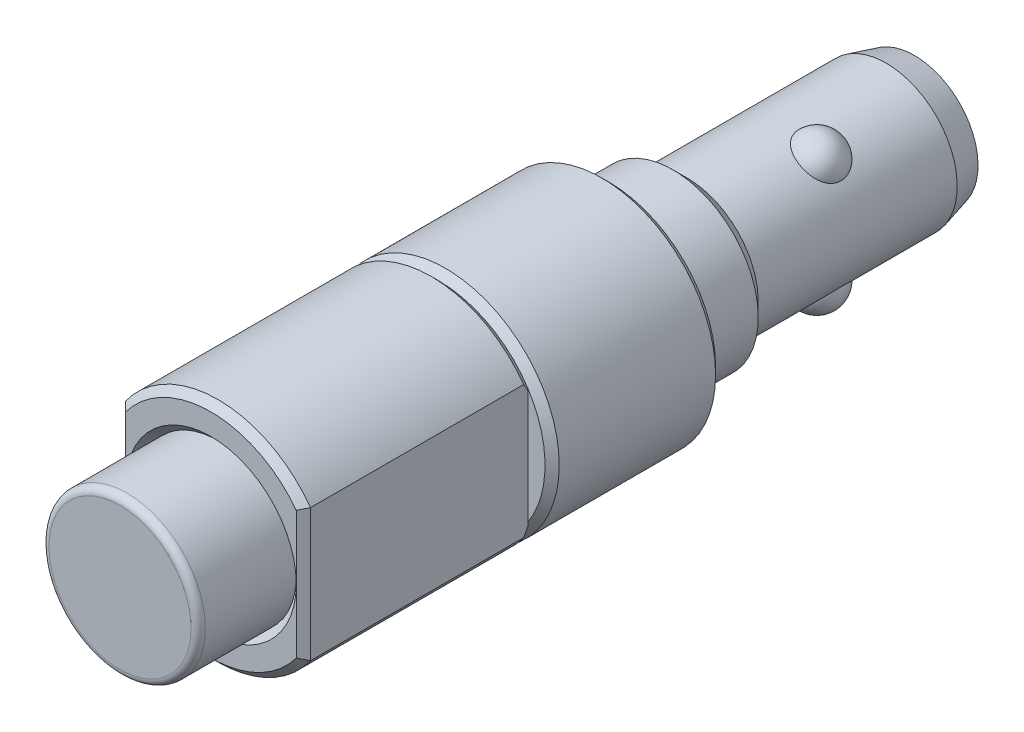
ISO-10303-21;
HEADER;
FILE_DESCRIPTION(('STEP AP214'),'2;1');
FILE_NAME('part.step','',(''),(''),'','','');
FILE_SCHEMA(('AUTOMOTIVE_DESIGN { 1 0 10303 214 1 1 1 1 }'));
ENDSEC;
DATA;
#1=APPLICATION_CONTEXT('core data for automotive mechanical design processes');
#2=APPLICATION_PROTOCOL_DEFINITION('international standard','automotive_design',2000,#1);
#3=PRODUCT_CONTEXT('',#1,'mechanical');
#4=PRODUCT('Part','Part','',(#3));
#5=PRODUCT_RELATED_PRODUCT_CATEGORY('part','',(#4));
#6=PRODUCT_DEFINITION_FORMATION('','',#4);
#7=PRODUCT_DEFINITION_CONTEXT('part definition',#1,'design');
#8=PRODUCT_DEFINITION('design','',#6,#7);
#9=PRODUCT_DEFINITION_SHAPE('','',#8);
#10=(LENGTH_UNIT() NAMED_UNIT(*) SI_UNIT(.MILLI.,.METRE.));
#11=(NAMED_UNIT(*) PLANE_ANGLE_UNIT() SI_UNIT($,.RADIAN.));
#12=(NAMED_UNIT(*) SI_UNIT($,.STERADIAN.) SOLID_ANGLE_UNIT());
#13=UNCERTAINTY_MEASURE_WITH_UNIT(LENGTH_MEASURE(1.E-05),#10,'distance_accuracy_value','');
#14=(GEOMETRIC_REPRESENTATION_CONTEXT(3) GLOBAL_UNCERTAINTY_ASSIGNED_CONTEXT((#13)) GLOBAL_UNIT_ASSIGNED_CONTEXT((#10,
#11,#12)) REPRESENTATION_CONTEXT('',''));
#15=CARTESIAN_POINT('',(0.,0.,0.));
#16=DIRECTION('',(0.,0.,1.));
#17=DIRECTION('',(1.,0.,0.));
#18=AXIS2_PLACEMENT_3D('',#15,#16,#17);
#19=CARTESIAN_POINT('',(2.5,0.,28.));
#20=DIRECTION('',(0.,0.,1.));
#21=DIRECTION('',(0.,-1.,0.));
#22=AXIS2_PLACEMENT_3D('',#19,#20,#21);
#23=PLANE('',#22);
#24=CARTESIAN_POINT('',(0.,0.,28.));
#25=DIRECTION('',(0.,0.,1.));
#26=DIRECTION('',(0.,-1.,0.));
#27=AXIS2_PLACEMENT_3D('',#24,#25,#26);
#28=CIRCLE('',#27,7.5);
#29=CARTESIAN_POINT('',(-6.,-4.5,28.));
#30=VERTEX_POINT('',#29);
#31=CARTESIAN_POINT('',(6.,-4.5,28.));
#32=VERTEX_POINT('',#31);
#33=EDGE_CURVE('E538',#30,#32,#28,.T.);
#34=ORIENTED_EDGE('',*,*,#33,.T.);
#35=DIRECTION('',(0.,1.,0.));
#36=VECTOR('',#35,1.);
#37=CARTESIAN_POINT('',(6.,3.74165738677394,28.));
#38=LINE('',#37,#36);
#39=CARTESIAN_POINT('',(6.,0.,28.));
#40=VERTEX_POINT('',#39);
#41=EDGE_CURVE('E262',#32,#40,#38,.T.);
#42=ORIENTED_EDGE('',*,*,#41,.T.);
#43=CARTESIAN_POINT('',(0.,0.,28.));
#44=DIRECTION('',(0.,0.,1.));
#45=DIRECTION('',(0.,-1.,0.));
#46=AXIS2_PLACEMENT_3D('',#43,#44,#45);
#47=CIRCLE('',#46,6.);
#48=CARTESIAN_POINT('',(-6.,0.,28.));
#49=VERTEX_POINT('',#48);
#50=EDGE_CURVE('E535',#40,#49,#47,.F.);
#51=ORIENTED_EDGE('',*,*,#50,.T.);
#52=DIRECTION('',(0.,-1.,0.));
#53=VECTOR('',#52,1.);
#54=CARTESIAN_POINT('',(-6.,-3.74165738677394,28.));
#55=LINE('',#54,#53);
#56=EDGE_CURVE('E300',#49,#30,#55,.T.);
#57=ORIENTED_EDGE('',*,*,#56,.T.);
#58=EDGE_LOOP('',(#34,#42,#51,#57));
#59=FACE_BOUND('',#58,.T.);
#60=ADVANCED_FACE('F14',(#59),#23,.T.);
#61=EDGE_CURVE('E257',#49,#40,#47,.F.);
#62=ORIENTED_EDGE('',*,*,#61,.T.);
#63=DIRECTION('',(0.,1.,0.));
#64=VECTOR('',#63,1.);
#65=CARTESIAN_POINT('',(6.,3.74165738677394,28.));
#66=LINE('',#65,#64);
#67=CARTESIAN_POINT('',(6.,4.5,28.));
#68=VERTEX_POINT('',#67);
#69=EDGE_CURVE('E37',#40,#68,#66,.T.);
#70=ORIENTED_EDGE('',*,*,#69,.T.);
#71=CARTESIAN_POINT('',(-6.,4.5,28.));
#72=VERTEX_POINT('',#71);
#73=EDGE_CURVE('E536',#68,#72,#28,.T.);
#74=ORIENTED_EDGE('',*,*,#73,.T.);
#75=DIRECTION('',(0.,-1.,0.));
#76=VECTOR('',#75,1.);
#77=CARTESIAN_POINT('',(-6.,-3.74165738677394,28.));
#78=LINE('',#77,#76);
#79=EDGE_CURVE('E297',#72,#49,#78,.T.);
#80=ORIENTED_EDGE('',*,*,#79,.T.);
#81=EDGE_LOOP('',(#62,#70,#74,#80));
#82=FACE_BOUND('',#81,.T.);
#83=ADVANCED_FACE('F641',(#82),#23,.T.);
#84=CARTESIAN_POINT('',(0.,0.,-5.5));
#85=DIRECTION('',(0.,0.,-1.));
#86=DIRECTION('',(0.,1.,0.));
#87=AXIS2_PLACEMENT_3D('',#84,#85,#86);
#88=CYLINDRICAL_SURFACE('',#87,8.);
#89=DIRECTION('',(0.,0.,-1.));
#90=VECTOR('',#89,1.);
#91=CARTESIAN_POINT('',(6.5,-4.66368952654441,-5.5));
#92=LINE('',#91,#90);
#93=CARTESIAN_POINT('',(6.5,-4.66368952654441,27.5));
#94=VERTEX_POINT('',#93);
#95=CARTESIAN_POINT('',(6.5,-4.66368952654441,12.5));
#96=VERTEX_POINT('',#95);
#97=EDGE_CURVE('E229',#94,#96,#92,.T.);
#98=ORIENTED_EDGE('',*,*,#97,.F.);
#99=CARTESIAN_POINT('',(0.,0.,27.5));
#100=DIRECTION('',(0.,0.,1.));
#101=DIRECTION('',(0.,-1.,0.));
#102=AXIS2_PLACEMENT_3D('',#99,#100,#101);
#103=CIRCLE('',#102,8.);
#104=CARTESIAN_POINT('',(-6.5,-4.66368952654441,27.5));
#105=VERTEX_POINT('',#104);
#106=EDGE_CURVE('E245',#94,#105,#103,.F.);
#107=ORIENTED_EDGE('',*,*,#106,.T.);
#108=DIRECTION('',(0.,0.,-1.));
#109=VECTOR('',#108,1.);
#110=CARTESIAN_POINT('',(-6.5,-4.66368952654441,-5.5));
#111=LINE('',#110,#109);
#112=CARTESIAN_POINT('',(-6.5,-4.66368952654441,12.5));
#113=VERTEX_POINT('',#112);
#114=EDGE_CURVE('E660',#113,#105,#111,.F.);
#115=ORIENTED_EDGE('',*,*,#114,.F.);
#116=CARTESIAN_POINT('',(0.,0.,12.5));
#117=DIRECTION('',(0.,0.,-1.));
#118=DIRECTION('',(0.,1.,0.));
#119=AXIS2_PLACEMENT_3D('',#116,#117,#118);
#120=CIRCLE('',#119,8.);
#121=EDGE_CURVE('E248',#113,#96,#120,.F.);
#122=ORIENTED_EDGE('',*,*,#121,.T.);
#123=EDGE_LOOP('',(#98,#107,#115,#122));
#124=FACE_BOUND('',#123,.T.);
#125=ADVANCED_FACE('F243',(#124),#88,.T.);
#126=CARTESIAN_POINT('',(-6.5,4.66368952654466,27.5));
#127=VERTEX_POINT('',#126);
#128=CARTESIAN_POINT('',(6.5,4.66368952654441,27.5));
#129=VERTEX_POINT('',#128);
#130=EDGE_CURVE('E256',#127,#129,#103,.F.);
#131=ORIENTED_EDGE('',*,*,#130,.T.);
#132=DIRECTION('',(0.,0.,-1.));
#133=VECTOR('',#132,1.);
#134=CARTESIAN_POINT('',(6.5,4.66368952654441,-5.5));
#135=LINE('',#134,#133);
#136=CARTESIAN_POINT('',(6.5,4.66368952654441,12.5));
#137=VERTEX_POINT('',#136);
#138=EDGE_CURVE('E232',#137,#129,#135,.F.);
#139=ORIENTED_EDGE('',*,*,#138,.F.);
#140=CARTESIAN_POINT('',(0.,0.,12.5));
#141=DIRECTION('',(0.,0.,-1.));
#142=DIRECTION('',(0.,1.,0.));
#143=AXIS2_PLACEMENT_3D('',#140,#141,#142);
#144=CIRCLE('',#143,8.);
#145=CARTESIAN_POINT('',(-6.5,4.66368952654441,12.5));
#146=VERTEX_POINT('',#145);
#147=EDGE_CURVE('E658',#137,#146,#144,.F.);
#148=ORIENTED_EDGE('',*,*,#147,.T.);
#149=DIRECTION('',(0.,0.,-1.));
#150=VECTOR('',#149,1.);
#151=CARTESIAN_POINT('',(-6.5,4.66368952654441,-5.5));
#152=LINE('',#151,#150);
#153=EDGE_CURVE('E608',#127,#146,#152,.T.);
#154=ORIENTED_EDGE('',*,*,#153,.F.);
#155=EDGE_LOOP('',(#131,#139,#148,#154));
#156=FACE_BOUND('',#155,.T.);
#157=ADVANCED_FACE('F720',(#156),#88,.T.);
#158=CARTESIAN_POINT('',(0.,0.,27.5));
#159=DIRECTION('',(0.,0.,-1.));
#160=DIRECTION('',(0.,1.,0.));
#161=AXIS2_PLACEMENT_3D('',#158,#159,#160);
#162=CONICAL_SURFACE('',#161,8.,0.785398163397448);
#163=ORIENTED_EDGE('',*,*,#106,.F.);
#164=CARTESIAN_POINT('',(6.5,-4.66368952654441,27.5));
#165=CARTESIAN_POINT('',(6.41659096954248,-4.63687044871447,27.5834090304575));
#166=CARTESIAN_POINT('',(6.33321979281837,-4.60982011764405,27.6667802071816));
#167=CARTESIAN_POINT('',(6.16655312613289,-4.55525694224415,27.8334468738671));
#168=CARTESIAN_POINT('',(6.08325763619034,-4.52774409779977,27.9167423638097));
#169=CARTESIAN_POINT('',(6.,-4.5,28.));
#170=B_SPLINE_CURVE_WITH_KNOTS('',3,(#164,#165,#166,#167,#168,#169),.UNSPECIFIED.,.F.,.F.,(4,2,
4),(0.,0.362903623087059,0.725807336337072),.UNSPECIFIED.);
#171=EDGE_CURVE('E23',#94,#32,#170,.T.);
#172=ORIENTED_EDGE('',*,*,#171,.T.);
#173=ORIENTED_EDGE('',*,*,#33,.F.);
#174=CARTESIAN_POINT('',(-6.,-4.5,28.));
#175=CARTESIAN_POINT('',(-6.08325763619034,-4.52774409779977,27.9167423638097));
#176=CARTESIAN_POINT('',(-6.1665531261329,-4.55525694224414,27.8334468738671));
#177=CARTESIAN_POINT('',(-6.33321979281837,-4.60982011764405,27.6667802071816));
#178=CARTESIAN_POINT('',(-6.41659096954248,-4.63687044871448,27.5834090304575));
#179=CARTESIAN_POINT('',(-6.5,-4.66368952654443,27.5));
#180=B_SPLINE_CURVE_WITH_KNOTS('',3,(#174,#175,#176,#177,#178,#179),.UNSPECIFIED.,.F.,.F.,(4,2,
4),(0.,0.362903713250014,0.725807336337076),.UNSPECIFIED.);
#181=EDGE_CURVE('E237',#30,#105,#180,.T.);
#182=ORIENTED_EDGE('',*,*,#181,.T.);
#183=EDGE_LOOP('',(#163,#172,#173,#182));
#184=FACE_BOUND('',#183,.T.);
#185=ADVANCED_FACE('F252',(#184),#162,.T.);
#186=ORIENTED_EDGE('',*,*,#73,.F.);
#187=CARTESIAN_POINT('',(6.,4.5,28.));
#188=CARTESIAN_POINT('',(6.08325763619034,4.52774409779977,27.9167423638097));
#189=CARTESIAN_POINT('',(6.16655312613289,4.55525694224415,27.8334468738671));
#190=CARTESIAN_POINT('',(6.33321979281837,4.60982011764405,27.6667802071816));
#191=CARTESIAN_POINT('',(6.41659096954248,4.63687044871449,27.5834090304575));
#192=CARTESIAN_POINT('',(6.5,4.66368952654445,27.5));
#193=B_SPLINE_CURVE_WITH_KNOTS('',3,(#187,#188,#189,#190,#191,#192),.UNSPECIFIED.,.F.,.F.,(4,2,
4),(0.,0.362903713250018,0.72580733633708),.UNSPECIFIED.);
#194=EDGE_CURVE('E238',#68,#129,#193,.T.);
#195=ORIENTED_EDGE('',*,*,#194,.T.);
#196=ORIENTED_EDGE('',*,*,#130,.F.);
#197=CARTESIAN_POINT('',(-6.5,4.66368952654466,27.5));
#198=CARTESIAN_POINT('',(-6.4165909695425,4.6368704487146,27.5834090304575));
#199=CARTESIAN_POINT('',(-6.33321979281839,4.60982011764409,27.6667802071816));
#200=CARTESIAN_POINT('',(-6.16655312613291,4.55525694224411,27.8334468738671));
#201=CARTESIAN_POINT('',(-6.08325763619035,4.52774409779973,27.9167423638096));
#202=CARTESIAN_POINT('',(-6.,4.5,28.));
#203=B_SPLINE_CURVE_WITH_KNOTS('',3,(#197,#198,#199,#200,#201,#202),.UNSPECIFIED.,.F.,.F.,(4,2,
4),(0.,0.362903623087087,0.725807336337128),.UNSPECIFIED.);
#204=EDGE_CURVE('E30',#127,#72,#203,.T.);
#205=ORIENTED_EDGE('',*,*,#204,.T.);
#206=EDGE_LOOP('',(#186,#195,#196,#205));
#207=FACE_BOUND('',#206,.T.);
#208=ADVANCED_FACE('F494',(#207),#162,.T.);
#209=CARTESIAN_POINT('',(2.12499999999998,3.68060796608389,-12.5));
#210=DIRECTION('',(0.,0.,1.));
#211=DIRECTION('',(0.499999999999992,0.866025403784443,0.));
#212=AXIS2_PLACEMENT_3D('',#209,#210,#211);
#213=SPHERICAL_SURFACE('',#212,1.75);
#214=CARTESIAN_POINT('',(3.81615799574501,3.23062504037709,-12.5));
#215=CARTESIAN_POINT('',(3.81615856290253,3.23062388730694,-12.5836499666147));
#216=CARTESIAN_POINT('',(3.81142908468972,3.23623588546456,-12.6672936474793));
#217=CARTESIAN_POINT('',(3.79259683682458,3.25828409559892,-12.8320541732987));
#218=CARTESIAN_POINT('',(3.77849350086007,3.2747209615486,-12.9131708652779));
#219=CARTESIAN_POINT('',(3.74119182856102,3.31726907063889,-13.0704191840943));
#220=CARTESIAN_POINT('',(3.71801221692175,3.34336039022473,-13.146560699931));
#221=CARTESIAN_POINT('',(3.6629223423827,3.40362449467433,-13.2921779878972));
#222=CARTESIAN_POINT('',(3.63101062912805,3.43779862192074,-13.3616526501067));
#223=CARTESIAN_POINT('',(3.55773995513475,3.51359457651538,-13.4946333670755));
#224=CARTESIAN_POINT('',(3.51610503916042,3.55542421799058,-13.5578683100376));
#225=CARTESIAN_POINT('',(3.42465626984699,3.64359185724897,-13.6745059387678));
#226=CARTESIAN_POINT('',(3.37484037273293,3.68993098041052,-13.7279061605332));
#227=CARTESIAN_POINT('',(3.26397629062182,3.78844703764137,-13.8274539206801));
#228=CARTESIAN_POINT('',(3.20238083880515,3.84080469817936,-13.8728141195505));
#229=CARTESIAN_POINT('',(3.07183723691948,3.94599101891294,-13.9505567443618));
#230=CARTESIAN_POINT('',(3.00288723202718,3.99881979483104,-13.982935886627));
#231=CARTESIAN_POINT('',(2.8558485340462,4.10520573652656,-14.0353781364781));
#232=CARTESIAN_POINT('',(2.7774903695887,4.15869157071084,-14.0548323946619));
#233=CARTESIAN_POINT('',(2.6162041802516,4.2620007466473,-14.078771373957));
#234=CARTESIAN_POINT('',(2.53327569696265,4.31182371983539,-14.0832545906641));
#235=CARTESIAN_POINT('',(2.36386505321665,4.40700729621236,-14.077139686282));
#236=CARTESIAN_POINT('',(2.27734904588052,4.45229396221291,-14.0663251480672));
#237=CARTESIAN_POINT('',(2.10450321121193,4.53655306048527,-14.0293867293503));
#238=CARTESIAN_POINT('',(2.01817339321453,4.57552518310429,-14.0032620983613));
#239=CARTESIAN_POINT('',(1.848600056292,4.64662549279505,-13.9361356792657));
#240=CARTESIAN_POINT('',(1.76535449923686,4.67875826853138,-13.8951439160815));
#241=CARTESIAN_POINT('',(1.6049043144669,4.73619555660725,-13.7989637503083));
#242=CARTESIAN_POINT('',(1.52769967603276,4.76150008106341,-13.7437753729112));
#243=CARTESIAN_POINT('',(1.38382978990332,4.8052651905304,-13.6213994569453));
#244=CARTESIAN_POINT('',(1.31699586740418,4.82384381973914,-13.5544530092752));
#245=CARTESIAN_POINT('',(1.19520689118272,4.85545560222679,-13.4093569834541));
#246=CARTESIAN_POINT('',(1.14024786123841,4.86849061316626,-13.3312111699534));
#247=CARTESIAN_POINT('',(1.04766973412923,4.8892254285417,-13.1703315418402));
#248=CARTESIAN_POINT('',(1.00926658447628,4.89717806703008,-13.0880825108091));
#249=CARTESIAN_POINT('',(0.947692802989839,4.90946814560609,-12.9178178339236));
#250=CARTESIAN_POINT('',(0.924513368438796,4.91380767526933,-12.8298055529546));
#251=CARTESIAN_POINT('',(0.895843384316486,4.91911166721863,-12.6575963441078));
#252=CARTESIAN_POINT('',(0.889164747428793,4.92030327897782,-12.5736029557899));
#253=CARTESIAN_POINT('',(0.890357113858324,4.92008807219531,-12.4057328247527));
#254=CARTESIAN_POINT('',(0.898224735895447,4.91868185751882,-12.3218560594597));
#255=CARTESIAN_POINT('',(0.927543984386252,4.91323400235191,-12.1597296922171));
#256=CARTESIAN_POINT('',(0.948499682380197,4.90928842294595,-12.0813861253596));
#257=CARTESIAN_POINT('',(1.0025421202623,4.89853681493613,-11.9292230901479));
#258=CARTESIAN_POINT('',(1.03563007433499,4.89173050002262,-11.8554040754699));
#259=CARTESIAN_POINT('',(1.11372110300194,4.8745528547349,-11.7117904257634));
#260=CARTESIAN_POINT('',(1.15906470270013,4.86407660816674,-11.6421940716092));
#261=CARTESIAN_POINT('',(1.25930447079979,4.83909248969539,-11.5110834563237));
#262=CARTESIAN_POINT('',(1.31420337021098,4.82458346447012,-11.4495715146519));
#263=CARTESIAN_POINT('',(1.43569870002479,4.78988768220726,-11.331739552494));
#264=CARTESIAN_POINT('',(1.50284404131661,4.76937540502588,-11.2760812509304));
#265=CARTESIAN_POINT('',(1.64341560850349,4.72278189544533,-11.1762048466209));
#266=CARTESIAN_POINT('',(1.71684368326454,4.69669902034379,-11.1319901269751));
#267=CARTESIAN_POINT('',(1.87221719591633,4.63703896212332,-11.0533437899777));
#268=CARTESIAN_POINT('',(1.95440907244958,4.60310275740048,-11.019669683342));
#269=CARTESIAN_POINT('',(2.12053266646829,4.52897530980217,-10.966462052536));
#270=CARTESIAN_POINT('',(2.20446467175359,4.48878302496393,-10.9469308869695));
#271=CARTESIAN_POINT('',(2.37392582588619,4.40156832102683,-10.9219492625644));
#272=CARTESIAN_POINT('',(2.45943345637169,4.3543855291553,-10.9169104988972));
#273=CARTESIAN_POINT('',(2.62717452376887,4.25528457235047,-10.9221641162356));
#274=CARTESIAN_POINT('',(2.7094077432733,4.20336609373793,-10.9324575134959));
#275=CARTESIAN_POINT('',(2.86887889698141,4.09619524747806,-10.9683227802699));
#276=CARTESIAN_POINT('',(2.94608601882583,4.04092571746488,-10.9939805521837));
#277=CARTESIAN_POINT('',(3.09312117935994,3.92951821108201,-11.0602463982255));
#278=CARTESIAN_POINT('',(3.16294893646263,3.87338020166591,-11.1008550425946));
#279=CARTESIAN_POINT('',(3.29320621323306,3.76324608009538,-11.1959932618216));
#280=CARTESIAN_POINT('',(3.35369996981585,3.70923742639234,-11.2504201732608));
#281=CARTESIAN_POINT('',(3.4646689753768,3.60580494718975,-11.3723232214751));
#282=CARTESIAN_POINT('',(3.51514532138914,3.5563806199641,-11.4397979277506));
#283=CARTESIAN_POINT('',(3.60354416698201,3.46674289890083,-11.5837595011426));
#284=CARTESIAN_POINT('',(3.64183981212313,3.42627048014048,-11.6598549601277));
#285=CARTESIAN_POINT('',(3.70745740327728,3.35516229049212,-11.8208661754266));
#286=CARTESIAN_POINT('',(3.73478577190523,3.32452076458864,-11.9057767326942));
#287=CARTESIAN_POINT('',(3.77618166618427,3.27740125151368,-12.0746046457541));
#288=CARTESIAN_POINT('',(3.79115111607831,3.25996966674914,-12.1580350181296));
#289=CARTESIAN_POINT('',(3.81113709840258,3.23658433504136,-12.3276465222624));
#290=CARTESIAN_POINT('',(3.81615741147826,3.23062622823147,-12.4138265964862));
#291=CARTESIAN_POINT('',(3.81615799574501,3.23062504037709,-12.5));
#292=B_SPLINE_CURVE_WITH_KNOTS('',3,(#214,#215,#216,#217,#218,#219,#220,#221,#222,#223,#224,
#225,#226,#227,#228,#229,#230,#231,#232,#233,#234,#235,#236,#237,#238,#239,#240,#241,#242,#243,
#244,#245,#246,#247,#248,#249,#250,#251,#252,#253,#254,#255,#256,#257,#258,#259,#260,#261,#262,
#263,#264,#265,#266,#267,#268,#269,#270,#271,#272,#273,#274,#275,#276,#277,#278,#279,#280,#281,
#282,#283,#284,#285,#286,#287,#288,#289,#290,#291),.UNSPECIFIED.,.T.,.F.,(4,2,2,2,2,2,2,2,2,2,2,
2,2,2,2,2,2,2,2,2,2,2,2,2,2,2,2,2,2,2,2,2,2,2,2,2,2,2,4),(0.,0.250624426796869,
0.501263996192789,0.751389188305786,1.0015559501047,1.25994238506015,1.51839346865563,
1.79525043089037,2.07217738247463,2.36136682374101,2.65058532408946,2.94393655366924,
3.23730216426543,3.53047032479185,3.82363796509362,4.11137744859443,4.39902043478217,
4.67092933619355,4.94268087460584,5.1942075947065,5.4456758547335,5.68814976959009,
5.93064795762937,6.18073628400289,6.43089620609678,6.69851064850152,6.96620411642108,
7.25016014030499,7.53416350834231,7.82615869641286,8.11817323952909,8.41183588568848,
8.70550973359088,8.99706249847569,9.28858331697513,9.57004289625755,9.85133740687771,
10.1096204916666,10.3678054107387),.UNSPECIFIED.);
#293=CARTESIAN_POINT('',(3.81615799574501,3.23062504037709,-12.5));
#294=VERTEX_POINT('',#293);
#295=EDGE_CURVE('E471',#294,#294,#292,.T.);
#296=ORIENTED_EDGE('',*,*,#295,.T.);
#297=EDGE_LOOP('',(#296));
#298=FACE_BOUND('',#297,.T.);
#299=ADVANCED_FACE('F489',(#298),#213,.T.);
#300=CARTESIAN_POINT('',(0.,0.,90.7115005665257));
#301=DIRECTION('',(0.,0.,1.));
#302=DIRECTION('',(0.,-1.,0.));
#303=AXIS2_PLACEMENT_3D('',#300,#301,#302);
#304=CYLINDRICAL_SURFACE('',#303,5.5);
#305=CARTESIAN_POINT('',(0.,0.,33.9));
#306=DIRECTION('',(0.,0.,-1.));
#307=DIRECTION('',(0.,1.,0.));
#308=AXIS2_PLACEMENT_3D('',#305,#306,#307);
#309=CIRCLE('',#308,5.5);
#310=CARTESIAN_POINT('',(0.,5.5,33.9));
#311=VERTEX_POINT('',#310);
#312=EDGE_CURVE('E379',#311,#311,#309,.T.);
#313=ORIENTED_EDGE('',*,*,#312,.T.);
#314=EDGE_LOOP('',(#313));
#315=FACE_BOUND('',#314,.T.);
#316=CARTESIAN_POINT('',(0.,0.,27.5));
#317=DIRECTION('',(0.,0.,1.));
#318=DIRECTION('',(0.,-1.,0.));
#319=AXIS2_PLACEMENT_3D('',#316,#317,#318);
#320=CIRCLE('',#319,5.5);
#321=CARTESIAN_POINT('',(0.,-5.5,27.5));
#322=VERTEX_POINT('',#321);
#323=EDGE_CURVE('E539',#322,#322,#320,.T.);
#324=ORIENTED_EDGE('',*,*,#323,.T.);
#325=EDGE_LOOP('',(#324));
#326=FACE_BOUND('',#325,.T.);
#327=ADVANCED_FACE('F493',(#315,#326),#304,.T.);
#328=CARTESIAN_POINT('',(0.,0.,33.9));
#329=DIRECTION('',(0.,0.,-1.));
#330=DIRECTION('',(0.,1.,0.));
#331=AXIS2_PLACEMENT_3D('',#328,#329,#330);
#332=TOROIDAL_SURFACE('',#331,5.,0.5);
#333=ORIENTED_EDGE('',*,*,#312,.F.);
#334=EDGE_LOOP('',(#333));
#335=FACE_BOUND('',#334,.T.);
#336=CARTESIAN_POINT('',(0.,0.,34.4));
#337=DIRECTION('',(0.,0.,-1.));
#338=DIRECTION('',(0.,1.,0.));
#339=AXIS2_PLACEMENT_3D('',#336,#337,#338);
#340=CIRCLE('',#339,5.);
#341=CARTESIAN_POINT('',(0.,5.,34.4));
#342=VERTEX_POINT('',#341);
#343=EDGE_CURVE('E443',#342,#342,#340,.F.);
#344=ORIENTED_EDGE('',*,*,#343,.F.);
#345=EDGE_LOOP('',(#344));
#346=FACE_BOUND('',#345,.T.);
#347=ADVANCED_FACE('F280',(#335,#346),#332,.T.);
#348=CARTESIAN_POINT('',(0.,0.,34.4));
#349=DIRECTION('',(0.,0.,-1.));
#350=DIRECTION('',(0.,1.,0.));
#351=AXIS2_PLACEMENT_3D('',#348,#349,#350);
#352=PLANE('',#351);
#353=ORIENTED_EDGE('',*,*,#343,.T.);
#354=EDGE_LOOP('',(#353));
#355=FACE_BOUND('',#354,.T.);
#356=ADVANCED_FACE('F739',(#355),#352,.F.);
#357=CARTESIAN_POINT('',(0.,0.,-15.5));
#358=DIRECTION('',(0.,0.,-1.));
#359=DIRECTION('',(0.,1.,0.));
#360=AXIS2_PLACEMENT_3D('',#357,#358,#359);
#361=PLANE('',#360);
#362=CARTESIAN_POINT('',(0.,0.,-15.5));
#363=DIRECTION('',(0.,0.,-1.));
#364=DIRECTION('',(0.,1.,0.));
#365=AXIS2_PLACEMENT_3D('',#362,#363,#364);
#366=CIRCLE('',#365,0.279422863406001);
#367=CARTESIAN_POINT('',(0.,0.279422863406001,-15.5));
#368=VERTEX_POINT('',#367);
#369=EDGE_CURVE('E515',#368,#368,#366,.F.);
#370=ORIENTED_EDGE('',*,*,#369,.F.);
#371=EDGE_LOOP('',(#370));
#372=FACE_BOUND('',#371,.T.);
#373=ADVANCED_FACE('F506',(#372),#361,.T.);
#374=CARTESIAN_POINT('',(0.514839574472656,-1.40887906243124,-16.1));
#375=DIRECTION('',(-0.98480775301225,-0.173648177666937,0.));
#376=DIRECTION('',(-0.173648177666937,0.98480775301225,0.));
#377=AXIS2_PLACEMENT_3D('',#374,#375,#376);
#378=PLANE('',#377);
#379=DIRECTION('',(0.173648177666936,-0.98480775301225,0.));
#380=VECTOR('',#379,1.);
#381=CARTESIAN_POINT('',(0.514839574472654,-1.40887906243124,-15.5));
#382=LINE('',#381,#380);
#383=CARTESIAN_POINT('',(0.514839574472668,-1.40887906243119,-15.5));
#384=VERTEX_POINT('',#383);
#385=CARTESIAN_POINT('',(0.645650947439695,-2.1507472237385,-15.5));
#386=VERTEX_POINT('',#385);
#387=EDGE_CURVE('E362',#384,#386,#382,.T.);
#388=ORIENTED_EDGE('',*,*,#387,.T.);
#389=DIRECTION('',(0.,0.,1.));
#390=VECTOR('',#389,1.);
#391=CARTESIAN_POINT('',(0.645650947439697,-2.1507472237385,-16.1));
#392=LINE('',#391,#390);
#393=CARTESIAN_POINT('',(0.645650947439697,-2.1507472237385,-16.1));
#394=VERTEX_POINT('',#393);
#395=EDGE_CURVE('E333',#394,#386,#392,.T.);
#396=ORIENTED_EDGE('',*,*,#395,.F.);
#397=DIRECTION('',(0.173648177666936,-0.98480775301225,0.));
#398=VECTOR('',#397,1.);
#399=CARTESIAN_POINT('',(0.514839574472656,-1.40887906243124,-16.1));
#400=LINE('',#399,#398);
#401=CARTESIAN_POINT('',(0.51483957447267,-1.40887906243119,-16.1));
#402=VERTEX_POINT('',#401);
#403=EDGE_CURVE('E387',#402,#394,#400,.T.);
#404=ORIENTED_EDGE('',*,*,#403,.F.);
#405=DIRECTION('',(0.,0.,-1.));
#406=VECTOR('',#405,1.);
#407=CARTESIAN_POINT('',(0.51483957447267,-1.40887906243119,-17.1));
#408=LINE('',#407,#406);
#409=EDGE_CURVE('E320',#402,#384,#408,.F.);
#410=ORIENTED_EDGE('',*,*,#409,.T.);
#411=EDGE_LOOP('',(#388,#396,#404,#410));
#412=FACE_BOUND('',#411,.T.);
#413=ADVANCED_FACE('F737',(#412),#378,.F.);
#414=CARTESIAN_POINT('',(0.941093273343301,-2.09865277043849,-16.1));
#415=DIRECTION('',(0.,0.,1.));
#416=DIRECTION('',(-1.00000000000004,0.,0.));
#417=AXIS2_PLACEMENT_3D('',#414,#415,#416);
#418=CYLINDRICAL_SURFACE('',#417,0.299999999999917);
#419=CARTESIAN_POINT('',(0.941093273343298,-2.09865277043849,-15.5));
#420=DIRECTION('',(0.,0.,1.));
#421=DIRECTION('',(1.00000000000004,0.,0.));
#422=AXIS2_PLACEMENT_3D('',#419,#420,#421);
#423=CIRCLE('',#422,0.299999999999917);
#424=CARTESIAN_POINT('',(1.06384456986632,-2.37239008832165,-15.5));
#425=VERTEX_POINT('',#424);
#426=EDGE_CURVE('E359',#386,#425,#423,.T.);
#427=ORIENTED_EDGE('',*,*,#426,.T.);
#428=DIRECTION('',(0.,0.,1.));
#429=VECTOR('',#428,1.);
#430=CARTESIAN_POINT('',(1.06384456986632,-2.37239008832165,-16.1));
#431=LINE('',#430,#429);
#432=CARTESIAN_POINT('',(1.06384456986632,-2.37239008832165,-16.1));
#433=VERTEX_POINT('',#432);
#434=EDGE_CURVE('E340',#433,#425,#431,.T.);
#435=ORIENTED_EDGE('',*,*,#434,.F.);
#436=CARTESIAN_POINT('',(0.941093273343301,-2.09865277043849,-16.1));
#437=DIRECTION('',(0.,0.,1.));
#438=DIRECTION('',(1.00000000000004,0.,0.));
#439=AXIS2_PLACEMENT_3D('',#436,#437,#438);
#440=CIRCLE('',#439,0.299999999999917);
#441=CARTESIAN_POINT('',(0.805993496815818,-2.36651103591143,-16.1));
#442=VERTEX_POINT('',#441);
#443=EDGE_CURVE('E384',#442,#433,#440,.T.);
#444=ORIENTED_EDGE('',*,*,#443,.F.);
#445=EDGE_CURVE('E385',#394,#442,#440,.T.);
#446=ORIENTED_EDGE('',*,*,#445,.F.);
#447=ORIENTED_EDGE('',*,*,#395,.T.);
#448=EDGE_LOOP('',(#427,#435,#444,#446,#447));
#449=FACE_BOUND('',#448,.T.);
#450=ADVANCED_FACE('F1173',(#449),#418,.F.);
#451=CARTESIAN_POINT('',(1.50000000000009,0.,-16.1));
#452=DIRECTION('',(0.,1.00000000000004,0.));
#453=DIRECTION('',(1.00000000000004,0.,0.));
#454=AXIS2_PLACEMENT_3D('',#451,#452,#453);
#455=PLANE('',#454);
#456=DIRECTION('',(-1.00000000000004,0.,0.));
#457=VECTOR('',#456,1.);
#458=CARTESIAN_POINT('',(1.50000000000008,0.,-15.5));
#459=LINE('',#458,#457);
#460=CARTESIAN_POINT('',(2.2803508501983,0.,-15.5));
#461=VERTEX_POINT('',#460);
#462=CARTESIAN_POINT('',(1.5,0.,-15.5));
#463=VERTEX_POINT('',#462);
#464=EDGE_CURVE('E350',#461,#463,#459,.T.);
#465=ORIENTED_EDGE('',*,*,#464,.T.);
#466=DIRECTION('',(0.,0.,-1.));
#467=VECTOR('',#466,1.);
#468=CARTESIAN_POINT('',(1.50000000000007,0.,-17.1));
#469=LINE('',#468,#467);
#470=CARTESIAN_POINT('',(1.5,0.,-16.1));
#471=VERTEX_POINT('',#470);
#472=EDGE_CURVE('E417',#463,#471,#469,.T.);
#473=ORIENTED_EDGE('',*,*,#472,.T.);
#474=DIRECTION('',(-1.00000000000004,0.,0.));
#475=VECTOR('',#474,1.);
#476=CARTESIAN_POINT('',(1.50000000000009,0.,-16.1));
#477=LINE('',#476,#475);
#478=CARTESIAN_POINT('',(2.2803508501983,0.,-16.1));
#479=VERTEX_POINT('',#478);
#480=EDGE_CURVE('E375',#479,#471,#477,.T.);
#481=ORIENTED_EDGE('',*,*,#480,.F.);
#482=DIRECTION('',(0.,0.,1.));
#483=VECTOR('',#482,1.);
#484=CARTESIAN_POINT('',(2.2803508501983,0.,-16.1));
#485=LINE('',#484,#483);
#486=EDGE_CURVE('E346',#479,#461,#485,.T.);
#487=ORIENTED_EDGE('',*,*,#486,.T.);
#488=EDGE_LOOP('',(#465,#473,#481,#487));
#489=FACE_BOUND('',#488,.T.);
#490=ADVANCED_FACE('F1165',(#489),#455,.F.);
#491=CARTESIAN_POINT('',(0.,0.,-17.1));
#492=DIRECTION('',(0.,0.,-1.));
#493=DIRECTION('',(0.,1.,0.));
#494=AXIS2_PLACEMENT_3D('',#491,#492,#493);
#495=CYLINDRICAL_SURFACE('',#494,1.5);
#496=CARTESIAN_POINT('',(0.,0.,-15.5));
#497=DIRECTION('',(0.,0.,-1.));
#498=DIRECTION('',(0.,1.,0.));
#499=AXIS2_PLACEMENT_3D('',#496,#497,#498);
#500=CIRCLE('',#499,1.5);
#501=EDGE_CURVE('E518',#384,#463,#500,.F.);
#502=ORIENTED_EDGE('',*,*,#501,.F.);
#503=ORIENTED_EDGE('',*,*,#409,.F.);
#504=CARTESIAN_POINT('',(0.,0.,-16.1));
#505=DIRECTION('',(0.,0.,-1.));
#506=DIRECTION('',(0.,1.,0.));
#507=AXIS2_PLACEMENT_3D('',#504,#505,#506);
#508=CIRCLE('',#507,1.5);
#509=EDGE_CURVE('E452',#471,#402,#508,.T.);
#510=ORIENTED_EDGE('',*,*,#509,.F.);
#511=ORIENTED_EDGE('',*,*,#472,.F.);
#512=EDGE_LOOP('',(#502,#503,#510,#511));
#513=FACE_BOUND('',#512,.T.);
#514=ADVANCED_FACE('F1043',(#513),#495,.T.);
#515=CARTESIAN_POINT('',(1.5,0.,-16.1));
#516=DIRECTION('',(0.,0.,-1.));
#517=DIRECTION('',(0.,1.,0.));
#518=AXIS2_PLACEMENT_3D('',#515,#516,#517);
#519=PLANE('',#518);
#520=ORIENTED_EDGE('',*,*,#509,.T.);
#521=ORIENTED_EDGE('',*,*,#403,.T.);
#522=ORIENTED_EDGE('',*,*,#445,.T.);
#523=CARTESIAN_POINT('',(0.,0.,-16.1));
#524=DIRECTION('',(0.,0.,-1.));
#525=DIRECTION('',(0.,1.,0.));
#526=AXIS2_PLACEMENT_3D('',#523,#524,#525);
#527=CIRCLE('',#526,2.5);
#528=CARTESIAN_POINT('',(2.49824021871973,-0.0937859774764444,-16.1));
#529=VERTEX_POINT('',#528);
#530=EDGE_CURVE('E459',#529,#442,#527,.T.);
#531=ORIENTED_EDGE('',*,*,#530,.F.);
#532=CARTESIAN_POINT('',(2.28035085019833,-0.300000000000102,-16.1));
#533=DIRECTION('',(0.,0.,1.));
#534=DIRECTION('',(1.00000000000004,0.,0.));
#535=AXIS2_PLACEMENT_3D('',#532,#533,#534);
#536=CIRCLE('',#535,0.300000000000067);
#537=EDGE_CURVE('E378',#529,#479,#536,.T.);
#538=ORIENTED_EDGE('',*,*,#537,.T.);
#539=ORIENTED_EDGE('',*,*,#480,.T.);
#540=EDGE_LOOP('',(#520,#521,#522,#531,#538,#539));
#541=FACE_BOUND('',#540,.T.);
#542=ADVANCED_FACE('F1052',(#541),#519,.F.);
#543=CARTESIAN_POINT('',(2.28035085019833,-0.300000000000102,-16.1));
#544=DIRECTION('',(0.,0.,1.));
#545=DIRECTION('',(-1.00000000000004,0.,0.));
#546=AXIS2_PLACEMENT_3D('',#543,#544,#545);
#547=CYLINDRICAL_SURFACE('',#546,0.300000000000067);
#548=CARTESIAN_POINT('',(2.28035085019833,-0.300000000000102,-15.5));
#549=DIRECTION('',(0.,0.,1.));
#550=DIRECTION('',(1.00000000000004,0.,0.));
#551=AXIS2_PLACEMENT_3D('',#548,#549,#550);
#552=CIRCLE('',#551,0.300000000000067);
#553=CARTESIAN_POINT('',(2.57778791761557,-0.33913043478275,-15.5));
#554=VERTEX_POINT('',#553);
#555=EDGE_CURVE('E353',#554,#461,#552,.T.);
#556=ORIENTED_EDGE('',*,*,#555,.T.);
#557=ORIENTED_EDGE('',*,*,#486,.F.);
#558=ORIENTED_EDGE('',*,*,#537,.F.);
#559=CARTESIAN_POINT('',(2.57778791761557,-0.33913043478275,-16.1));
#560=VERTEX_POINT('',#559);
#561=EDGE_CURVE('E349',#560,#529,#536,.T.);
#562=ORIENTED_EDGE('',*,*,#561,.F.);
#563=DIRECTION('',(0.,0.,1.));
#564=VECTOR('',#563,1.);
#565=CARTESIAN_POINT('',(2.57778791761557,-0.33913043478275,-16.1));
#566=LINE('',#565,#564);
#567=EDGE_CURVE('E343',#560,#554,#566,.T.);
#568=ORIENTED_EDGE('',*,*,#567,.T.);
#569=EDGE_LOOP('',(#556,#557,#558,#562,#568));
#570=FACE_BOUND('',#569,.T.);
#571=ADVANCED_FACE('F1141',(#570),#547,.F.);
#572=CARTESIAN_POINT('',(0.,0.,-16.1));
#573=DIRECTION('',(0.,0.,1.));
#574=DIRECTION('',(-1.00000000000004,0.,0.));
#575=AXIS2_PLACEMENT_3D('',#572,#573,#574);
#576=CYLINDRICAL_SURFACE('',#575,2.60000000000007);
#577=CARTESIAN_POINT('',(0.,0.,-15.5));
#578=DIRECTION('',(0.,0.,1.));
#579=DIRECTION('',(1.00000000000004,0.,0.));
#580=AXIS2_PLACEMENT_3D('',#577,#578,#579);
#581=CIRCLE('',#580,2.60000000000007);
#582=EDGE_CURVE('E356',#425,#554,#581,.T.);
#583=ORIENTED_EDGE('',*,*,#582,.T.);
#584=ORIENTED_EDGE('',*,*,#567,.F.);
#585=CARTESIAN_POINT('',(0.,0.,-16.1));
#586=DIRECTION('',(0.,0.,1.));
#587=DIRECTION('',(1.00000000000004,0.,0.));
#588=AXIS2_PLACEMENT_3D('',#585,#586,#587);
#589=CIRCLE('',#588,2.60000000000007);
#590=EDGE_CURVE('E382',#433,#560,#589,.T.);
#591=ORIENTED_EDGE('',*,*,#590,.F.);
#592=ORIENTED_EDGE('',*,*,#434,.T.);
#593=EDGE_LOOP('',(#583,#584,#591,#592));
#594=FACE_BOUND('',#593,.T.);
#595=ADVANCED_FACE('F1132',(#594),#576,.F.);
#596=CARTESIAN_POINT('',(-2.28035085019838,0.,-16.1));
#597=DIRECTION('',(0.,1.00000000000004,0.));
#598=DIRECTION('',(0.,0.,1.));
#599=AXIS2_PLACEMENT_3D('',#596,#597,#598);
#600=PLANE('',#599);
#601=DIRECTION('',(1.,0.,0.));
#602=VECTOR('',#601,1.);
#603=CARTESIAN_POINT('',(0.,0.,-15.5));
#604=LINE('',#603,#602);
#605=CARTESIAN_POINT('',(-2.28035085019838,0.,-15.5));
#606=VERTEX_POINT('',#605);
#607=CARTESIAN_POINT('',(-1.50000000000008,0.,-15.5));
#608=VERTEX_POINT('',#607);
#609=EDGE_CURVE('E374',#606,#608,#604,.T.);
#610=ORIENTED_EDGE('',*,*,#609,.F.);
#611=DIRECTION('',(0.,0.,1.));
#612=VECTOR('',#611,1.);
#613=CARTESIAN_POINT('',(-2.28035085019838,0.,-16.1));
#614=LINE('',#613,#612);
#615=CARTESIAN_POINT('',(-2.28035085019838,0.,-16.1));
#616=VERTEX_POINT('',#615);
#617=EDGE_CURVE('E316',#616,#606,#614,.T.);
#618=ORIENTED_EDGE('',*,*,#617,.F.);
#619=DIRECTION('',(-1.00000000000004,0.,0.));
#620=VECTOR('',#619,1.);
#621=CARTESIAN_POINT('',(-2.28035085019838,0.,-16.1));
#622=LINE('',#621,#620);
#623=CARTESIAN_POINT('',(-1.5,0.,-16.1));
#624=VERTEX_POINT('',#623);
#625=EDGE_CURVE('E401',#624,#616,#622,.T.);
#626=ORIENTED_EDGE('',*,*,#625,.F.);
#627=DIRECTION('',(0.,0.,-1.));
#628=VECTOR('',#627,1.);
#629=CARTESIAN_POINT('',(-1.50000000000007,0.,-17.1));
#630=LINE('',#629,#628);
#631=EDGE_CURVE('E321',#624,#608,#630,.F.);
#632=ORIENTED_EDGE('',*,*,#631,.T.);
#633=EDGE_LOOP('',(#610,#618,#626,#632));
#634=FACE_BOUND('',#633,.T.);
#635=ADVANCED_FACE('F1123',(#634),#600,.F.);
#636=CARTESIAN_POINT('',(-2.28035085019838,-0.300000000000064,-16.1));
#637=DIRECTION('',(0.,0.,1.));
#638=DIRECTION('',(-1.00000000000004,0.,0.));
#639=AXIS2_PLACEMENT_3D('',#636,#637,#638);
#640=CYLINDRICAL_SURFACE('',#639,0.300000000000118);
#641=CARTESIAN_POINT('',(-2.28035085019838,-0.300000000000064,-15.5));
#642=DIRECTION('',(0.,0.,1.));
#643=DIRECTION('',(1.00000000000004,0.,0.));
#644=AXIS2_PLACEMENT_3D('',#641,#642,#643);
#645=CIRCLE('',#644,0.300000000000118);
#646=CARTESIAN_POINT('',(-2.57778791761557,-0.339130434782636,-15.5));
#647=VERTEX_POINT('',#646);
#648=EDGE_CURVE('E371',#606,#647,#645,.T.);
#649=ORIENTED_EDGE('',*,*,#648,.T.);
#650=DIRECTION('',(0.,0.,1.));
#651=VECTOR('',#650,1.);
#652=CARTESIAN_POINT('',(-2.57778791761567,-0.339130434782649,-16.1));
#653=LINE('',#652,#651);
#654=CARTESIAN_POINT('',(-2.57778791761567,-0.339130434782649,-16.1));
#655=VERTEX_POINT('',#654);
#656=EDGE_CURVE('E324',#655,#647,#653,.T.);
#657=ORIENTED_EDGE('',*,*,#656,.F.);
#658=CARTESIAN_POINT('',(-2.28035085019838,-0.300000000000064,-16.1));
#659=DIRECTION('',(0.,0.,1.));
#660=DIRECTION('',(1.00000000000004,0.,0.));
#661=AXIS2_PLACEMENT_3D('',#658,#659,#660);
#662=CIRCLE('',#661,0.300000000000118);
#663=CARTESIAN_POINT('',(-2.49824021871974,-0.093785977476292,-16.1));
#664=VERTEX_POINT('',#663);
#665=EDGE_CURVE('E398',#664,#655,#662,.T.);
#666=ORIENTED_EDGE('',*,*,#665,.F.);
#667=EDGE_CURVE('E399',#616,#664,#662,.T.);
#668=ORIENTED_EDGE('',*,*,#667,.F.);
#669=ORIENTED_EDGE('',*,*,#617,.T.);
#670=EDGE_LOOP('',(#649,#657,#666,#668,#669));
#671=FACE_BOUND('',#670,.T.);
#672=ADVANCED_FACE('F1114',(#671),#640,.F.);
#673=CARTESIAN_POINT('',(-0.514839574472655,-1.40887906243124,-16.1));
#674=DIRECTION('',(0.984807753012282,-0.173648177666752,0.));
#675=DIRECTION('',(-0.173648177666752,-0.984807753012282,0.));
#676=AXIS2_PLACEMENT_3D('',#673,#674,#675);
#677=PLANE('',#676);
#678=DIRECTION('',(-0.173648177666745,-0.984807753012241,0.));
#679=VECTOR('',#678,1.);
#680=CARTESIAN_POINT('',(-0.258382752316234,0.0455598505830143,-15.5));
#681=LINE('',#680,#679);
#682=CARTESIAN_POINT('',(-0.514839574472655,-1.40887906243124,-15.5));
#683=VERTEX_POINT('',#682);
#684=CARTESIAN_POINT('',(-0.645650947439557,-2.15074722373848,-15.5));
#685=VERTEX_POINT('',#684);
#686=EDGE_CURVE('E370',#683,#685,#681,.T.);
#687=ORIENTED_EDGE('',*,*,#686,.F.);
#688=DIRECTION('',(0.,0.,1.));
#689=VECTOR('',#688,1.);
#690=CARTESIAN_POINT('',(-0.514839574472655,-1.40887906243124,-16.1));
#691=LINE('',#690,#689);
#692=CARTESIAN_POINT('',(-0.51483957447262,-1.40887906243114,-16.1));
#693=VERTEX_POINT('',#692);
#694=EDGE_CURVE('E334',#693,#683,#691,.T.);
#695=ORIENTED_EDGE('',*,*,#694,.F.);
#696=DIRECTION('',(0.173648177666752,0.984807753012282,0.));
#697=VECTOR('',#696,1.);
#698=CARTESIAN_POINT('',(-0.514839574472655,-1.40887906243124,-16.1));
#699=LINE('',#698,#697);
#700=CARTESIAN_POINT('',(-0.64565094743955,-2.15074722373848,-16.1));
#701=VERTEX_POINT('',#700);
#702=EDGE_CURVE('E389',#701,#693,#699,.T.);
#703=ORIENTED_EDGE('',*,*,#702,.F.);
#704=DIRECTION('',(0.,0.,1.));
#705=VECTOR('',#704,1.);
#706=CARTESIAN_POINT('',(-0.64565094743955,-2.15074722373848,-16.1));
#707=LINE('',#706,#705);
#708=EDGE_CURVE('E330',#701,#685,#707,.T.);
#709=ORIENTED_EDGE('',*,*,#708,.T.);
#710=EDGE_LOOP('',(#687,#695,#703,#709));
#711=FACE_BOUND('',#710,.T.);
#712=ADVANCED_FACE('F1106',(#711),#677,.F.);
#713=EDGE_CURVE('E365',#608,#683,#500,.F.);
#714=ORIENTED_EDGE('',*,*,#713,.F.);
#715=ORIENTED_EDGE('',*,*,#631,.F.);
#716=EDGE_CURVE('E456',#693,#624,#508,.T.);
#717=ORIENTED_EDGE('',*,*,#716,.F.);
#718=ORIENTED_EDGE('',*,*,#694,.T.);
#719=EDGE_LOOP('',(#714,#715,#717,#718));
#720=FACE_BOUND('',#719,.T.);
#721=ADVANCED_FACE('F1042',(#720),#495,.T.);
#722=ORIENTED_EDGE('',*,*,#716,.T.);
#723=ORIENTED_EDGE('',*,*,#625,.T.);
#724=ORIENTED_EDGE('',*,*,#667,.T.);
#725=CARTESIAN_POINT('',(-0.80599349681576,-2.36651103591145,-16.1));
#726=VERTEX_POINT('',#725);
#727=EDGE_CURVE('E1331',#726,#664,#527,.T.);
#728=ORIENTED_EDGE('',*,*,#727,.F.);
#729=CARTESIAN_POINT('',(-0.941093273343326,-2.09865277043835,-16.1));
#730=DIRECTION('',(0.,0.,1.));
#731=DIRECTION('',(1.00000000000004,0.,0.));
#732=AXIS2_PLACEMENT_3D('',#729,#730,#731);
#733=CIRCLE('',#732,0.300000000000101);
#734=EDGE_CURVE('E392',#726,#701,#733,.T.);
#735=ORIENTED_EDGE('',*,*,#734,.T.);
#736=ORIENTED_EDGE('',*,*,#702,.T.);
#737=EDGE_LOOP('',(#722,#723,#724,#728,#735,#736));
#738=FACE_BOUND('',#737,.T.);
#739=ADVANCED_FACE('F1051',(#738),#519,.F.);
#740=CARTESIAN_POINT('',(-0.941093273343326,-2.09865277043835,-16.1));
#741=DIRECTION('',(0.,0.,1.));
#742=DIRECTION('',(-1.00000000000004,0.,0.));
#743=AXIS2_PLACEMENT_3D('',#740,#741,#742);
#744=CYLINDRICAL_SURFACE('',#743,0.300000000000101);
#745=CARTESIAN_POINT('',(-0.941093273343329,-2.09865277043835,-15.5));
#746=DIRECTION('',(0.,0.,1.));
#747=DIRECTION('',(1.00000000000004,0.,0.));
#748=AXIS2_PLACEMENT_3D('',#745,#746,#747);
#749=CIRCLE('',#748,0.300000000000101);
#750=CARTESIAN_POINT('',(-1.06384456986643,-2.37239008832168,-15.5));
#751=VERTEX_POINT('',#750);
#752=EDGE_CURVE('E366',#751,#685,#749,.T.);
#753=ORIENTED_EDGE('',*,*,#752,.T.);
#754=ORIENTED_EDGE('',*,*,#708,.F.);
#755=ORIENTED_EDGE('',*,*,#734,.F.);
#756=CARTESIAN_POINT('',(-1.06384456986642,-2.37239008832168,-16.1));
#757=VERTEX_POINT('',#756);
#758=EDGE_CURVE('E393',#757,#726,#733,.T.);
#759=ORIENTED_EDGE('',*,*,#758,.F.);
#760=DIRECTION('',(0.,0.,1.));
#761=VECTOR('',#760,1.);
#762=CARTESIAN_POINT('',(-1.06384456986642,-2.37239008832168,-16.1));
#763=LINE('',#762,#761);
#764=EDGE_CURVE('E327',#757,#751,#763,.T.);
#765=ORIENTED_EDGE('',*,*,#764,.T.);
#766=EDGE_LOOP('',(#753,#754,#755,#759,#765));
#767=FACE_BOUND('',#766,.T.);
#768=ADVANCED_FACE('F1082',(#767),#744,.F.);
#769=CARTESIAN_POINT('',(0.,0.,-16.1));
#770=DIRECTION('',(0.,0.,1.));
#771=DIRECTION('',(-1.00000000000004,0.,0.));
#772=AXIS2_PLACEMENT_3D('',#769,#770,#771);
#773=CYLINDRICAL_SURFACE('',#772,2.60000000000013);
#774=CARTESIAN_POINT('',(0.,0.,-15.5));
#775=DIRECTION('',(0.,0.,-1.));
#776=DIRECTION('',(0.,1.,0.));
#777=AXIS2_PLACEMENT_3D('',#774,#775,#776);
#778=CIRCLE('',#777,2.60000000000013);
#779=EDGE_CURVE('E369',#751,#647,#778,.T.);
#780=ORIENTED_EDGE('',*,*,#779,.F.);
#781=ORIENTED_EDGE('',*,*,#764,.F.);
#782=CARTESIAN_POINT('',(0.,0.,-16.1));
#783=DIRECTION('',(0.,0.,1.));
#784=DIRECTION('',(1.00000000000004,0.,0.));
#785=AXIS2_PLACEMENT_3D('',#782,#783,#784);
#786=CIRCLE('',#785,2.60000000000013);
#787=EDGE_CURVE('E396',#655,#757,#786,.T.);
#788=ORIENTED_EDGE('',*,*,#787,.F.);
#789=ORIENTED_EDGE('',*,*,#656,.T.);
#790=EDGE_LOOP('',(#780,#781,#788,#789));
#791=FACE_BOUND('',#790,.T.);
#792=ADVANCED_FACE('F1074',(#791),#773,.F.);
#793=CARTESIAN_POINT('',(1.30000000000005,0.748331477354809,-16.1));
#794=DIRECTION('',(0.939692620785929,-0.342020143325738,0.));
#795=DIRECTION('',(-0.342020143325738,-0.939692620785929,0.));
#796=AXIS2_PLACEMENT_3D('',#793,#794,#795);
#797=PLANE('',#796);
#798=DIRECTION('',(-0.342020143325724,-0.939692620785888,0.));
#799=VECTOR('',#798,1.);
#800=CARTESIAN_POINT('',(0.907419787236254,-0.330273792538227,-15.5));
#801=LINE('',#800,#799);
#802=CARTESIAN_POINT('',(1.91263991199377,2.43154580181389,-15.5));
#803=VERTEX_POINT('',#802);
#804=CARTESIAN_POINT('',(1.3,0.748331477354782,-15.5));
#805=VERTEX_POINT('',#804);
#806=EDGE_CURVE('E352',#803,#805,#801,.T.);
#807=ORIENTED_EDGE('',*,*,#806,.F.);
#808=DIRECTION('',(0.,0.,1.));
#809=VECTOR('',#808,1.);
#810=CARTESIAN_POINT('',(1.91263991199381,2.43154580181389,-16.1));
#811=LINE('',#810,#809);
#812=CARTESIAN_POINT('',(1.91263991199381,2.43154580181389,-16.1));
#813=VERTEX_POINT('',#812);
#814=EDGE_CURVE('E303',#813,#803,#811,.T.);
#815=ORIENTED_EDGE('',*,*,#814,.F.);
#816=DIRECTION('',(0.342020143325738,0.939692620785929,0.));
#817=VECTOR('',#816,1.);
#818=CARTESIAN_POINT('',(1.30000000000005,0.748331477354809,-16.1));
#819=LINE('',#818,#817);
#820=CARTESIAN_POINT('',(1.69610878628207,1.83663142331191,-16.1));
#821=VERTEX_POINT('',#820);
#822=EDGE_CURVE('E413',#821,#813,#819,.T.);
#823=ORIENTED_EDGE('',*,*,#822,.F.);
#824=CARTESIAN_POINT('',(1.30000000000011,0.748331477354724,-16.1));
#825=VERTEX_POINT('',#824);
#826=EDGE_CURVE('E414',#825,#821,#819,.T.);
#827=ORIENTED_EDGE('',*,*,#826,.F.);
#828=DIRECTION('',(0.,0.,-1.));
#829=VECTOR('',#828,1.);
#830=CARTESIAN_POINT('',(1.3000000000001,0.748331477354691,-17.1));
#831=LINE('',#830,#829);
#832=EDGE_CURVE('E437',#825,#805,#831,.F.);
#833=ORIENTED_EDGE('',*,*,#832,.T.);
#834=EDGE_LOOP('',(#807,#815,#823,#827,#833));
#835=FACE_BOUND('',#834,.T.);
#836=ADVANCED_FACE('F281',(#835),#797,.F.);
#837=CARTESIAN_POINT('',(2.1945476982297,2.32893975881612,-16.1));
#838=DIRECTION('',(0.,0.,1.));
#839=DIRECTION('',(-1.00000000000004,0.,0.));
#840=AXIS2_PLACEMENT_3D('',#837,#838,#839);
#841=CYLINDRICAL_SURFACE('',#840,0.300000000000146);
#842=CARTESIAN_POINT('',(2.1945476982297,2.32893975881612,-15.5));
#843=DIRECTION('',(0.,0.,-1.));
#844=DIRECTION('',(0.,1.,0.));
#845=AXIS2_PLACEMENT_3D('',#842,#843,#844);
#846=CIRCLE('',#845,0.300000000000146);
#847=CARTESIAN_POINT('',(2.40028654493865,2.54727786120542,-15.5));
#848=VERTEX_POINT('',#847);
#849=EDGE_CURVE('E526',#848,#803,#846,.F.);
#850=ORIENTED_EDGE('',*,*,#849,.F.);
#851=DIRECTION('',(0.,0.,1.));
#852=VECTOR('',#851,1.);
#853=CARTESIAN_POINT('',(2.40028654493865,2.54727786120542,-16.1));
#854=LINE('',#853,#852);
#855=CARTESIAN_POINT('',(2.40028654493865,2.54727786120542,-16.1));
#856=VERTEX_POINT('',#855);
#857=EDGE_CURVE('E307',#856,#848,#854,.T.);
#858=ORIENTED_EDGE('',*,*,#857,.F.);
#859=CARTESIAN_POINT('',(2.1945476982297,2.32893975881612,-16.1));
#860=DIRECTION('',(0.,0.,-1.));
#861=DIRECTION('',(1.00000000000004,0.,0.));
#862=AXIS2_PLACEMENT_3D('',#859,#860,#861);
#863=CIRCLE('',#862,0.300000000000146);
#864=EDGE_CURVE('E411',#813,#856,#863,.T.);
#865=ORIENTED_EDGE('',*,*,#864,.F.);
#866=ORIENTED_EDGE('',*,*,#814,.T.);
#867=EDGE_LOOP('',(#850,#858,#865,#866));
#868=FACE_BOUND('',#867,.T.);
#869=ADVANCED_FACE('F1059',(#868),#841,.T.);
#870=CARTESIAN_POINT('',(0.,0.,-16.1));
#871=DIRECTION('',(0.,0.,-1.));
#872=DIRECTION('',(1.00000000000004,0.,0.));
#873=AXIS2_PLACEMENT_3D('',#870,#871,#872);
#874=PLANE('',#873);
#875=EDGE_CURVE('E1325',#442,#726,#527,.T.);
#876=ORIENTED_EDGE('',*,*,#875,.F.);
#877=ORIENTED_EDGE('',*,*,#443,.T.);
#878=ORIENTED_EDGE('',*,*,#590,.T.);
#879=ORIENTED_EDGE('',*,*,#561,.T.);
#880=EDGE_CURVE('E457',#821,#529,#527,.T.);
#881=ORIENTED_EDGE('',*,*,#880,.F.);
#882=ORIENTED_EDGE('',*,*,#822,.T.);
#883=ORIENTED_EDGE('',*,*,#864,.T.);
#884=CARTESIAN_POINT('',(0.,0.,-16.1));
#885=DIRECTION('',(0.,0.,-1.));
#886=DIRECTION('',(1.00000000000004,0.,0.));
#887=AXIS2_PLACEMENT_3D('',#884,#885,#886);
#888=CIRCLE('',#887,3.5);
#889=CARTESIAN_POINT('',(-2.40028654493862,2.54727786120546,-16.1));
#890=VERTEX_POINT('',#889);
#891=EDGE_CURVE('E409',#856,#890,#888,.T.);
#892=ORIENTED_EDGE('',*,*,#891,.T.);
#893=CARTESIAN_POINT('',(-2.19454769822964,2.32893975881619,-16.1));
#894=DIRECTION('',(0.,0.,-1.));
#895=DIRECTION('',(1.00000000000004,0.,0.));
#896=AXIS2_PLACEMENT_3D('',#893,#894,#895);
#897=CIRCLE('',#896,0.300000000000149);
#898=CARTESIAN_POINT('',(-1.91263991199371,2.43154580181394,-16.1));
#899=VERTEX_POINT('',#898);
#900=EDGE_CURVE('E407',#890,#899,#897,.T.);
#901=ORIENTED_EDGE('',*,*,#900,.T.);
#902=DIRECTION('',(0.342020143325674,-0.939692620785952,0.));
#903=VECTOR('',#902,1.);
#904=CARTESIAN_POINT('',(-1.30000000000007,0.748331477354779,-16.1));
#905=LINE('',#904,#903);
#906=CARTESIAN_POINT('',(-1.69610878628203,1.83663142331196,-16.1));
#907=VERTEX_POINT('',#906);
#908=EDGE_CURVE('E404',#899,#907,#905,.T.);
#909=ORIENTED_EDGE('',*,*,#908,.T.);
#910=EDGE_CURVE('E1332',#664,#907,#527,.T.);
#911=ORIENTED_EDGE('',*,*,#910,.F.);
#912=ORIENTED_EDGE('',*,*,#665,.T.);
#913=ORIENTED_EDGE('',*,*,#787,.T.);
#914=ORIENTED_EDGE('',*,*,#758,.T.);
#915=EDGE_LOOP('',(#876,#877,#878,#879,#881,#882,#883,#892,#901,#909,#911,#912,#913,#914));
#916=FACE_BOUND('',#915,.T.);
#917=ADVANCED_FACE('F507',(#916),#874,.T.);
#918=CARTESIAN_POINT('',(-1.30000000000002,0.748331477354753,-16.1));
#919=VERTEX_POINT('',#918);
#920=EDGE_CURVE('E453',#919,#825,#508,.T.);
#921=ORIENTED_EDGE('',*,*,#920,.T.);
#922=ORIENTED_EDGE('',*,*,#826,.T.);
#923=EDGE_CURVE('E460',#907,#821,#527,.T.);
#924=ORIENTED_EDGE('',*,*,#923,.F.);
#925=EDGE_CURVE('E403',#907,#919,#905,.T.);
#926=ORIENTED_EDGE('',*,*,#925,.T.);
#927=EDGE_LOOP('',(#921,#922,#924,#926));
#928=FACE_BOUND('',#927,.T.);
#929=ADVANCED_FACE('F1040',(#928),#519,.F.);
#930=CARTESIAN_POINT('',(-1.30000000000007,0.748331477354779,-15.5));
#931=VERTEX_POINT('',#930);
#932=EDGE_CURVE('E521',#805,#931,#500,.F.);
#933=ORIENTED_EDGE('',*,*,#932,.F.);
#934=ORIENTED_EDGE('',*,*,#832,.F.);
#935=ORIENTED_EDGE('',*,*,#920,.F.);
#936=DIRECTION('',(0.,0.,1.));
#937=VECTOR('',#936,1.);
#938=CARTESIAN_POINT('',(-1.30000000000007,0.748331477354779,-16.1));
#939=LINE('',#938,#937);
#940=EDGE_CURVE('E317',#919,#931,#939,.T.);
#941=ORIENTED_EDGE('',*,*,#940,.T.);
#942=EDGE_LOOP('',(#933,#934,#935,#941));
#943=FACE_BOUND('',#942,.T.);
#944=ADVANCED_FACE('F754',(#943),#495,.T.);
#945=CARTESIAN_POINT('',(0.,0.,-16.1));
#946=DIRECTION('',(0.,0.,1.));
#947=DIRECTION('',(-1.00000000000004,0.,0.));
#948=AXIS2_PLACEMENT_3D('',#945,#946,#947);
#949=CYLINDRICAL_SURFACE('',#948,3.5);
#950=CARTESIAN_POINT('',(0.,0.,-15.5));
#951=DIRECTION('',(0.,0.,-1.));
#952=DIRECTION('',(0.,1.,0.));
#953=AXIS2_PLACEMENT_3D('',#950,#951,#952);
#954=CIRCLE('',#953,3.5);
#955=CARTESIAN_POINT('',(-2.40028654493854,2.54727786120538,-15.5));
#956=VERTEX_POINT('',#955);
#957=EDGE_CURVE('E524',#956,#848,#954,.F.);
#958=ORIENTED_EDGE('',*,*,#957,.F.);
#959=DIRECTION('',(0.,0.,1.));
#960=VECTOR('',#959,1.);
#961=CARTESIAN_POINT('',(-2.40028654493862,2.54727786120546,-16.1));
#962=LINE('',#961,#960);
#963=EDGE_CURVE('E310',#890,#956,#962,.T.);
#964=ORIENTED_EDGE('',*,*,#963,.F.);
#965=ORIENTED_EDGE('',*,*,#891,.F.);
#966=ORIENTED_EDGE('',*,*,#857,.T.);
#967=EDGE_LOOP('',(#958,#964,#965,#966));
#968=FACE_BOUND('',#967,.T.);
#969=ADVANCED_FACE('F1023',(#968),#949,.T.);
#970=CARTESIAN_POINT('',(-2.19454769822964,2.32893975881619,-16.1));
#971=DIRECTION('',(0.,0.,1.));
#972=DIRECTION('',(-1.00000000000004,0.,0.));
#973=AXIS2_PLACEMENT_3D('',#970,#971,#972);
#974=CYLINDRICAL_SURFACE('',#973,0.300000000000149);
#975=CARTESIAN_POINT('',(-2.19454769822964,2.32893975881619,-15.5));
#976=DIRECTION('',(0.,0.,-1.));
#977=DIRECTION('',(0.,1.,0.));
#978=AXIS2_PLACEMENT_3D('',#975,#976,#977);
#979=CIRCLE('',#978,0.300000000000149);
#980=CARTESIAN_POINT('',(-1.91263991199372,2.43154580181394,-15.5));
#981=VERTEX_POINT('',#980);
#982=EDGE_CURVE('E522',#981,#956,#979,.F.);
#983=ORIENTED_EDGE('',*,*,#982,.F.);
#984=DIRECTION('',(0.,0.,1.));
#985=VECTOR('',#984,1.);
#986=CARTESIAN_POINT('',(-1.91263991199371,2.43154580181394,-16.1));
#987=LINE('',#986,#985);
#988=EDGE_CURVE('E313',#899,#981,#987,.T.);
#989=ORIENTED_EDGE('',*,*,#988,.F.);
#990=ORIENTED_EDGE('',*,*,#900,.F.);
#991=ORIENTED_EDGE('',*,*,#963,.T.);
#992=EDGE_LOOP('',(#983,#989,#990,#991));
#993=FACE_BOUND('',#992,.T.);
#994=ADVANCED_FACE('F1013',(#993),#974,.T.);
#995=CARTESIAN_POINT('',(-1.30000000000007,0.748331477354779,-16.1));
#996=DIRECTION('',(-0.939692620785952,-0.342020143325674,0.));
#997=DIRECTION('',(-0.342020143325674,0.939692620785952,0.));
#998=AXIS2_PLACEMENT_3D('',#995,#996,#997);
#999=PLANE('',#998);
#1000=DIRECTION('',(-0.342020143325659,0.939692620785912,0.));
#1001=VECTOR('',#1000,1.);
#1002=CARTESIAN_POINT('',(-0.90741978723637,-0.330273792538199,-15.5));
#1003=LINE('',#1002,#1001);
#1004=EDGE_CURVE('E519',#931,#981,#1003,.T.);
#1005=ORIENTED_EDGE('',*,*,#1004,.F.);
#1006=ORIENTED_EDGE('',*,*,#940,.F.);
#1007=ORIENTED_EDGE('',*,*,#925,.F.);
#1008=ORIENTED_EDGE('',*,*,#908,.F.);
#1009=ORIENTED_EDGE('',*,*,#988,.T.);
#1010=EDGE_LOOP('',(#1005,#1006,#1007,#1008,#1009));
#1011=FACE_BOUND('',#1010,.T.);
#1012=ADVANCED_FACE('F760',(#1011),#999,.F.);
#1013=CARTESIAN_POINT('',(0.,0.,90.7115005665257));
#1014=DIRECTION('',(0.,0.,1.));
#1015=DIRECTION('',(0.,-1.,0.));
#1016=AXIS2_PLACEMENT_3D('',#1013,#1014,#1015);
#1017=CYLINDRICAL_SURFACE('',#1016,2.5);
#1018=CARTESIAN_POINT('',(0.,0.,-16.9));
#1019=DIRECTION('',(0.,0.,1.));
#1020=DIRECTION('',(0.,-1.,0.));
#1021=AXIS2_PLACEMENT_3D('',#1018,#1019,#1020);
#1022=CIRCLE('',#1021,2.5);
#1023=CARTESIAN_POINT('',(0.,-2.5,-16.9));
#1024=VERTEX_POINT('',#1023);
#1025=EDGE_CURVE('E449',#1024,#1024,#1022,.T.);
#1026=ORIENTED_EDGE('',*,*,#1025,.T.);
#1027=EDGE_LOOP('',(#1026));
#1028=FACE_BOUND('',#1027,.T.);
#1029=ORIENTED_EDGE('',*,*,#880,.T.);
#1030=ORIENTED_EDGE('',*,*,#530,.T.);
#1031=ORIENTED_EDGE('',*,*,#875,.T.);
#1032=ORIENTED_EDGE('',*,*,#727,.T.);
#1033=ORIENTED_EDGE('',*,*,#910,.T.);
#1034=ORIENTED_EDGE('',*,*,#923,.T.);
#1035=EDGE_LOOP('',(#1029,#1030,#1031,#1032,#1033,#1034));
#1036=FACE_BOUND('',#1035,.T.);
#1037=ADVANCED_FACE('F756',(#1028,#1036),#1017,.T.);
#1038=CARTESIAN_POINT('',(0.,0.,-16.9));
#1039=DIRECTION('',(0.,0.,1.));
#1040=DIRECTION('',(0.,-1.,0.));
#1041=AXIS2_PLACEMENT_3D('',#1038,#1039,#1040);
#1042=CONICAL_SURFACE('',#1041,2.5,0.785398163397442);
#1043=CARTESIAN_POINT('',(0.,0.,-17.1));
#1044=DIRECTION('',(0.,0.,1.));
#1045=DIRECTION('',(0.,-1.,0.));
#1046=AXIS2_PLACEMENT_3D('',#1043,#1044,#1045);
#1047=CIRCLE('',#1046,2.3);
#1048=CARTESIAN_POINT('',(0.,-2.3,-17.1));
#1049=VERTEX_POINT('',#1048);
#1050=EDGE_CURVE('E446',#1049,#1049,#1047,.F.);
#1051=ORIENTED_EDGE('',*,*,#1050,.F.);
#1052=EDGE_LOOP('',(#1051));
#1053=FACE_BOUND('',#1052,.T.);
#1054=ORIENTED_EDGE('',*,*,#1025,.F.);
#1055=EDGE_LOOP('',(#1054));
#1056=FACE_BOUND('',#1055,.T.);
#1057=ADVANCED_FACE('F759',(#1053,#1056),#1042,.T.);
#1058=CARTESIAN_POINT('',(0.,0.,-15.620577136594));
#1059=DIRECTION('',(0.,0.,-1.));
#1060=DIRECTION('',(1.,0.,0.));
#1061=AXIS2_PLACEMENT_3D('',#1058,#1059,#1060);
#1062=CONICAL_SURFACE('',#1061,0.4,0.785398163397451);
#1063=ORIENTED_EDGE('',*,*,#369,.T.);
#1064=EDGE_LOOP('',(#1063));
#1065=FACE_BOUND('',#1064,.T.);
#1066=CARTESIAN_POINT('',(0.,0.,-15.620577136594));
#1067=DIRECTION('',(0.,0.,1.));
#1068=DIRECTION('',(-1.,0.,0.));
#1069=AXIS2_PLACEMENT_3D('',#1066,#1067,#1068);
#1070=CIRCLE('',#1069,0.4);
#1071=CARTESIAN_POINT('',(-0.4,0.,-15.620577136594));
#1072=VERTEX_POINT('',#1071);
#1073=EDGE_CURVE('E421',#1072,#1072,#1070,.T.);
#1074=ORIENTED_EDGE('',*,*,#1073,.F.);
#1075=EDGE_LOOP('',(#1074));
#1076=FACE_BOUND('',#1075,.T.);
#1077=ADVANCED_FACE('F770',(#1065,#1076),#1062,.F.);
#1078=CARTESIAN_POINT('',(0.,0.,-15.220577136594));
#1079=DIRECTION('',(0.,0.,1.));
#1080=DIRECTION('',(-1.,0.,0.));
#1081=AXIS2_PLACEMENT_3D('',#1078,#1079,#1080);
#1082=CYLINDRICAL_SURFACE('',#1081,0.4);
#1083=ORIENTED_EDGE('',*,*,#1073,.T.);
#1084=EDGE_LOOP('',(#1083));
#1085=FACE_BOUND('',#1084,.T.);
#1086=CARTESIAN_POINT('',(0.,0.,-16.320577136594));
#1087=DIRECTION('',(0.,0.,1.));
#1088=DIRECTION('',(-1.,0.,0.));
#1089=AXIS2_PLACEMENT_3D('',#1086,#1087,#1088);
#1090=CIRCLE('',#1089,0.4);
#1091=CARTESIAN_POINT('',(-0.4,0.,-16.320577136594));
#1092=VERTEX_POINT('',#1091);
#1093=EDGE_CURVE('E464',#1092,#1092,#1090,.T.);
#1094=ORIENTED_EDGE('',*,*,#1093,.F.);
#1095=EDGE_LOOP('',(#1094));
#1096=FACE_BOUND('',#1095,.T.);
#1097=ADVANCED_FACE('F748',(#1085,#1096),#1082,.F.);
#1098=CARTESIAN_POINT('',(0.,0.,-17.1));
#1099=DIRECTION('',(0.,0.,-1.));
#1100=DIRECTION('',(1.,0.,0.));
#1101=AXIS2_PLACEMENT_3D('',#1098,#1099,#1100);
#1102=CONICAL_SURFACE('',#1101,0.85,0.523598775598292);
#1103=ORIENTED_EDGE('',*,*,#1093,.T.);
#1104=EDGE_LOOP('',(#1103));
#1105=FACE_BOUND('',#1104,.T.);
#1106=CARTESIAN_POINT('',(0.,0.,-17.1));
#1107=DIRECTION('',(0.,0.,1.));
#1108=DIRECTION('',(-1.,0.,0.));
#1109=AXIS2_PLACEMENT_3D('',#1106,#1107,#1108);
#1110=CIRCLE('',#1109,0.85);
#1111=CARTESIAN_POINT('',(-0.85,0.,-17.1));
#1112=VERTEX_POINT('',#1111);
#1113=EDGE_CURVE('E461',#1112,#1112,#1110,.T.);
#1114=ORIENTED_EDGE('',*,*,#1113,.F.);
#1115=EDGE_LOOP('',(#1114));
#1116=FACE_BOUND('',#1115,.T.);
#1117=ADVANCED_FACE('F742',(#1105,#1116),#1102,.F.);
#1118=CARTESIAN_POINT('',(2.5,0.,-17.1));
#1119=DIRECTION('',(0.,0.,1.));
#1120=DIRECTION('',(0.,-1.,0.));
#1121=AXIS2_PLACEMENT_3D('',#1118,#1119,#1120);
#1122=PLANE('',#1121);
#1123=ORIENTED_EDGE('',*,*,#1050,.T.);
#1124=EDGE_LOOP('',(#1123));
#1125=FACE_BOUND('',#1124,.T.);
#1126=ORIENTED_EDGE('',*,*,#1113,.T.);
#1127=EDGE_LOOP('',(#1126));
#1128=FACE_BOUND('',#1127,.T.);
#1129=ADVANCED_FACE('F504',(#1125,#1128),#1122,.F.);
#1130=CARTESIAN_POINT('',(2.12500000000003,-3.68060796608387,-12.5));
#1131=DIRECTION('',(0.,0.,1.));
#1132=DIRECTION('',(0.5,-0.866025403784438,0.));
#1133=AXIS2_PLACEMENT_3D('',#1130,#1131,#1132);
#1134=SPHERICAL_SURFACE('',#1133,1.75);
#1135=CARTESIAN_POINT('',(3.81615799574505,-3.23062504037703,-12.5));
#1136=CARTESIAN_POINT('',(3.81615856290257,-3.23062388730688,-12.4163500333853));
#1137=CARTESIAN_POINT('',(3.81142908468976,-3.23623588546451,-12.3327063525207));
#1138=CARTESIAN_POINT('',(3.79259683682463,-3.25828409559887,-12.1679458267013));
#1139=CARTESIAN_POINT('',(3.77849350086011,-3.27472096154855,-12.0868291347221));
#1140=CARTESIAN_POINT('',(3.74119182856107,-3.31726907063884,-11.9295808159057));
#1141=CARTESIAN_POINT('',(3.7180122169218,-3.34336039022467,-11.853439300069));
#1142=CARTESIAN_POINT('',(3.66292234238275,-3.40362449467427,-11.7078220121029));
#1143=CARTESIAN_POINT('',(3.6310106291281,-3.43779862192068,-11.6383473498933));
#1144=CARTESIAN_POINT('',(3.55773995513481,-3.51359457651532,-11.5053666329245));
#1145=CARTESIAN_POINT('',(3.51610503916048,-3.55542421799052,-11.4421316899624));
#1146=CARTESIAN_POINT('',(3.42465626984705,-3.64359185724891,-11.3254940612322));
#1147=CARTESIAN_POINT('',(3.374840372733,-3.68993098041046,-11.2720938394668));
#1148=CARTESIAN_POINT('',(3.26397629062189,-3.78844703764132,-11.1725460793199));
#1149=CARTESIAN_POINT('',(3.20238083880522,-3.8408046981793,-11.1271858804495));
#1150=CARTESIAN_POINT('',(3.07183723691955,-3.94599101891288,-11.0494432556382));
#1151=CARTESIAN_POINT('',(3.00288723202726,-3.99881979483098,-11.017064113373));
#1152=CARTESIAN_POINT('',(2.85584853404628,-4.10520573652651,-10.9646218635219));
#1153=CARTESIAN_POINT('',(2.77749036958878,-4.15869157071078,-10.9451676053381));
#1154=CARTESIAN_POINT('',(2.61620418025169,-4.26200074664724,-10.921228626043));
#1155=CARTESIAN_POINT('',(2.53327569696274,-4.31182371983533,-10.9167454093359));
#1156=CARTESIAN_POINT('',(2.36386505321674,-4.40700729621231,-10.922860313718));
#1157=CARTESIAN_POINT('',(2.27734904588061,-4.45229396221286,-10.9336748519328));
#1158=CARTESIAN_POINT('',(2.10450321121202,-4.53655306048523,-10.9706132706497));
#1159=CARTESIAN_POINT('',(2.01817339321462,-4.57552518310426,-10.9967379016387));
#1160=CARTESIAN_POINT('',(1.84860005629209,-4.64662549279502,-11.0638643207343));
#1161=CARTESIAN_POINT('',(1.76535449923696,-4.67875826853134,-11.1048560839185));
#1162=CARTESIAN_POINT('',(1.604904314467,-4.73619555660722,-11.2010362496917));
#1163=CARTESIAN_POINT('',(1.52769967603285,-4.76150008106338,-11.2562246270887));
#1164=CARTESIAN_POINT('',(1.38382978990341,-4.80526519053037,-11.3786005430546));
#1165=CARTESIAN_POINT('',(1.31699586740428,-4.82384381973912,-11.4455469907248));
#1166=CARTESIAN_POINT('',(1.19520689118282,-4.85545560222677,-11.5906430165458));
#1167=CARTESIAN_POINT('',(1.1402478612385,-4.86849061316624,-11.6687888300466));
#1168=CARTESIAN_POINT('',(1.04766973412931,-4.88922542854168,-11.8296684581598));
#1169=CARTESIAN_POINT('',(1.00926658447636,-4.89717806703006,-11.9119174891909));
#1170=CARTESIAN_POINT('',(0.947692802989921,-4.90946814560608,-12.0821821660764));
#1171=CARTESIAN_POINT('',(0.924513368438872,-4.91380767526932,-12.1701944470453));
#1172=CARTESIAN_POINT('',(0.895843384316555,-4.91911166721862,-12.3424036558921));
#1173=CARTESIAN_POINT('',(0.889164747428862,-4.9203032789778,-12.42639704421));
#1174=CARTESIAN_POINT('',(0.890357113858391,-4.92008807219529,-12.5942671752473));
#1175=CARTESIAN_POINT('',(0.898224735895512,-4.91868185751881,-12.6781439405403));
#1176=CARTESIAN_POINT('',(0.927543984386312,-4.9132340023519,-12.8402703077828));
#1177=CARTESIAN_POINT('',(0.948499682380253,-4.90928842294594,-12.9186138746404));
#1178=CARTESIAN_POINT('',(1.00254212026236,-4.89853681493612,-13.0707769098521));
#1179=CARTESIAN_POINT('',(1.03563007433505,-4.89173050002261,-13.14459592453));
#1180=CARTESIAN_POINT('',(1.11372110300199,-4.87455285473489,-13.2882095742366));
#1181=CARTESIAN_POINT('',(1.15906470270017,-4.86407660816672,-13.3578059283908));
#1182=CARTESIAN_POINT('',(1.25930447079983,-4.83909248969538,-13.4889165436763));
#1183=CARTESIAN_POINT('',(1.31420337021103,-4.82458346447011,-13.5504284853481));
#1184=CARTESIAN_POINT('',(1.43569870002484,-4.78988768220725,-13.6682604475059));
#1185=CARTESIAN_POINT('',(1.50284404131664,-4.76937540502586,-13.7239187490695));
#1186=CARTESIAN_POINT('',(1.64341560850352,-4.72278189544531,-13.823795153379));
#1187=CARTESIAN_POINT('',(1.71684368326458,-4.69669902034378,-13.8680098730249));
#1188=CARTESIAN_POINT('',(1.87221719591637,-4.63703896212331,-13.9466562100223));
#1189=CARTESIAN_POINT('',(1.95440907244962,-4.60310275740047,-13.980330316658));
#1190=CARTESIAN_POINT('',(2.12053266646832,-4.52897530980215,-14.033537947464));
#1191=CARTESIAN_POINT('',(2.20446467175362,-4.48878302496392,-14.0530691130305));
#1192=CARTESIAN_POINT('',(2.37392582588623,-4.40156832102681,-14.0780507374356));
#1193=CARTESIAN_POINT('',(2.45943345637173,-4.35438552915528,-14.0830895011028));
#1194=CARTESIAN_POINT('',(2.6271745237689,-4.25528457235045,-14.0778358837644));
#1195=CARTESIAN_POINT('',(2.70940774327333,-4.20336609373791,-14.0675424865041));
#1196=CARTESIAN_POINT('',(2.86887889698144,-4.09619524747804,-14.0316772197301));
#1197=CARTESIAN_POINT('',(2.94608601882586,-4.04092571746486,-14.0060194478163));
#1198=CARTESIAN_POINT('',(3.09312117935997,-3.92951821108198,-13.9397536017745));
#1199=CARTESIAN_POINT('',(3.16294893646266,-3.87338020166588,-13.8991449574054));
#1200=CARTESIAN_POINT('',(3.29320621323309,-3.76324608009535,-13.8040067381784));
#1201=CARTESIAN_POINT('',(3.35369996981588,-3.70923742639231,-13.7495798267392));
#1202=CARTESIAN_POINT('',(3.46466897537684,-3.60580494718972,-13.6276767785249));
#1203=CARTESIAN_POINT('',(3.51514532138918,-3.55638061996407,-13.5602020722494));
#1204=CARTESIAN_POINT('',(3.60354416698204,-3.46674289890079,-13.4162404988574));
#1205=CARTESIAN_POINT('',(3.64183981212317,-3.42627048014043,-13.3401450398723));
#1206=CARTESIAN_POINT('',(3.70745740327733,-3.35516229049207,-13.1791338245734));
#1207=CARTESIAN_POINT('',(3.73478577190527,-3.32452076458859,-13.0942232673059));
#1208=CARTESIAN_POINT('',(3.77618166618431,-3.27740125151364,-12.9253953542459));
#1209=CARTESIAN_POINT('',(3.79115111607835,-3.25996966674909,-12.8419649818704));
#1210=CARTESIAN_POINT('',(3.81113709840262,-3.23658433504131,-12.6723534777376));
#1211=CARTESIAN_POINT('',(3.8161574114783,-3.23062622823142,-12.5861734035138));
#1212=CARTESIAN_POINT('',(3.81615799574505,-3.23062504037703,-12.5));
#1213=B_SPLINE_CURVE_WITH_KNOTS('',3,(#1135,#1136,#1137,#1138,#1139,#1140,#1141,#1142,#1143,
#1144,#1145,#1146,#1147,#1148,#1149,#1150,#1151,#1152,#1153,#1154,#1155,#1156,#1157,#1158,#1159,
#1160,#1161,#1162,#1163,#1164,#1165,#1166,#1167,#1168,#1169,#1170,#1171,#1172,#1173,#1174,#1175,
#1176,#1177,#1178,#1179,#1180,#1181,#1182,#1183,#1184,#1185,#1186,#1187,#1188,#1189,#1190,#1191,
#1192,#1193,#1194,#1195,#1196,#1197,#1198,#1199,#1200,#1201,#1202,#1203,#1204,#1205,#1206,#1207,
#1208,#1209,#1210,#1211,#1212),.UNSPECIFIED.,.T.,.F.,(4,2,2,2,2,2,2,2,2,2,2,2,2,2,2,2,2,2,2,2,2,
2,2,2,2,2,2,2,2,2,2,2,2,2,2,2,2,2,4),(0.,0.250624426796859,0.501263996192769,0.751389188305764,
1.00155595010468,1.25994238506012,1.5183934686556,1.79525043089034,2.07217738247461,
2.36136682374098,2.65058532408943,2.94393655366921,3.2373021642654,3.53047032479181,
3.82363796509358,4.11137744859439,4.39902043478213,4.67092933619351,4.94268087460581,
5.19420759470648,5.44567585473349,5.68814976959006,5.93064795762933,6.18073628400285,
6.43089620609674,6.69851064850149,6.96620411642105,7.25016014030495,7.53416350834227,
7.82615869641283,8.11817323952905,8.41183588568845,8.70550973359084,8.99706249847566,
9.28858331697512,9.57004289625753,9.85133740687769,10.1096204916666,10.3678054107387),.UNSPECIFIED.);
#1214=CARTESIAN_POINT('',(3.81615799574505,-3.23062504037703,-12.5));
#1215=VERTEX_POINT('',#1214);
#1216=EDGE_CURVE('E509',#1215,#1215,#1213,.T.);
#1217=ORIENTED_EDGE('',*,*,#1216,.T.);
#1218=EDGE_LOOP('',(#1217));
#1219=FACE_BOUND('',#1218,.T.);
#1220=ADVANCED_FACE('F500',(#1219),#1134,.T.);
#1221=CARTESIAN_POINT('',(-4.25,0.,-12.5));
#1222=DIRECTION('',(0.,0.,1.));
#1223=DIRECTION('',(-1.,0.,0.));
#1224=AXIS2_PLACEMENT_3D('',#1221,#1222,#1223);
#1225=SPHERICAL_SURFACE('',#1224,1.75);
#1226=CARTESIAN_POINT('',(-4.70588235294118,-1.68957724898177,-12.5));
#1227=CARTESIAN_POINT('',(-4.7058816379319,-1.68957831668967,-12.4163500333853));
#1228=CARTESIAN_POINT('',(-4.70837703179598,-1.68267646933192,-12.3327063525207));
#1229=CARTESIAN_POINT('',(-4.71805521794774,-1.65534315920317,-12.1679458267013));
#1230=CARTESIAN_POINT('',(-4.72523829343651,-1.63491087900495,-12.0868291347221));
#1231=CARTESIAN_POINT('',(-4.74343520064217,-1.58133262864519,-11.9295808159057));
#1232=CARTESIAN_POINT('',(-4.75444114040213,-1.54821283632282,-11.853439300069));
#1233=CARTESIAN_POINT('',(-4.77908644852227,-1.4703715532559,-11.7078220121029));
#1234=CARTESIAN_POINT('',(-4.7927262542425,-1.42564813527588,-11.6383473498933));
#1235=CARTESIAN_POINT('',(-4.82173213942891,-1.32429589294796,-11.5053666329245));
#1236=CARTESIAN_POINT('',(-4.83714021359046,-1.26732417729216,-11.4421316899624));
#1237=CARTESIAN_POINT('',(-4.86777124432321,-1.14404340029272,-11.3254940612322));
#1238=CARTESIAN_POINT('',(-4.88299415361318,-1.07773200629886,-11.2720938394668));
#1239=CARTESIAN_POINT('',(-4.91287952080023,-0.932462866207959,-11.1725460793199));
#1240=CARTESIAN_POINT('',(-4.92742485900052,-0.852940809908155,-11.1271858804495));
#1241=CARTESIAN_POINT('',(-4.95324708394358,-0.687293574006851,-11.0494432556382));
#1242=CARTESIAN_POINT('',(-4.96452314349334,-0.60116673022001,-11.017064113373));
#1243=CARTESIAN_POINT('',(-4.98313672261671,-0.420634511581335,-10.9646218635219));
#1244=CARTESIAN_POINT('',(-4.99027773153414,-0.326031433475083,-10.9451676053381));
#1245=CARTESIAN_POINT('',(-4.99910300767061,-0.134698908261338,-10.921228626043));
#1246=CARTESIAN_POINT('',(-5.00078672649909,-0.0379692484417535,-10.9167454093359));
#1247=CARTESIAN_POINT('',(-4.99851279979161,0.156336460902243,-10.922860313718));
#1248=CARTESIAN_POINT('',(-4.99447419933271,0.253904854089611,-10.9336748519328));
#1249=CARTESIAN_POINT('',(-4.98102180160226,0.445723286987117,-10.9706132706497));
#1250=CARTESIAN_POINT('',(-4.97160774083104,0.539973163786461,-10.9967379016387));
#1251=CARTESIAN_POINT('',(-4.94839574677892,0.722378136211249,-11.0638643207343));
#1252=CARTESIAN_POINT('',(-4.93460076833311,0.810537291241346,-11.1048560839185));
#1253=CARTESIAN_POINT('',(-4.90411782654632,0.978209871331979,-11.2010362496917));
#1254=CARTESIAN_POINT('',(-4.88742986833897,1.05772331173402,-11.2562246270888));
#1255=CARTESIAN_POINT('',(-4.85339662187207,1.20420084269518,-11.3786005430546));
#1256=CARTESIAN_POINT('',(-4.83606922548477,1.27137003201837,-11.4455469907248));
#1257=CARTESIAN_POINT('',(-4.80255134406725,1.39264827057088,-11.5906430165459));
#1258=CARTESIAN_POINT('',(-4.78636047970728,1.44676169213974,-11.6687888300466));
#1259=CARTESIAN_POINT('',(-4.7580282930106,1.5373041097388,-11.8296684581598));
#1260=CARTESIAN_POINT('',(-4.74571390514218,1.57453853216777,-11.9119174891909));
#1261=CARTESIAN_POINT('',(-4.72557053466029,1.63400803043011,-12.0821821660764));
#1262=CARTESIAN_POINT('',(-4.7177389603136,1.6562517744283,-12.1701944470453));
#1263=CARTESIAN_POINT('',(-4.70799736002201,1.68373270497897,-12.3424036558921));
#1264=CARTESIAN_POINT('',(-4.70569000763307,1.69011238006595,-12.42639704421));
#1265=CARTESIAN_POINT('',(-4.70609981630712,1.6889721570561,-12.5942671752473));
#1266=CARTESIAN_POINT('',(-4.70881580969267,1.68145548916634,-12.6781439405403));
#1267=CARTESIAN_POINT('',(-4.71875745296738,1.65334034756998,-12.8402703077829));
#1268=CARTESIAN_POINT('',(-4.72581832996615,1.63321939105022,-12.9186138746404));
#1269=CARTESIAN_POINT('',(-4.74352838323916,1.58104146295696,-13.0707769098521));
#1270=CARTESIAN_POINT('',(-4.75417791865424,1.548983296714,-13.14459592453));
#1271=CARTESIAN_POINT('',(-4.77834715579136,1.47276565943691,-13.2882095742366));
#1272=CARTESIAN_POINT('',(-4.79194625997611,1.42825882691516,-13.3578059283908));
#1273=CARTESIAN_POINT('',(-4.8204292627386,1.32895658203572,-13.4889165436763));
#1274=CARTESIAN_POINT('',(-4.83531352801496,1.27415822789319,-13.5504284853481));
#1275=CARTESIAN_POINT('',(-4.86601376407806,1.15159229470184,-13.6682604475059));
#1276=CARTESIAN_POINT('',(-4.88182228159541,1.08318658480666,-13.7239187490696));
#1277=CARTESIAN_POINT('',(-4.91175690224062,0.938151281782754,-13.8237951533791));
#1278=CARTESIAN_POINT('',(-4.92588250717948,0.861519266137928,-13.8680098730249));
#1279=CARTESIAN_POINT('',(-4.95190213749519,0.697131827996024,-13.9466562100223));
#1280=CARTESIAN_POINT('',(-4.96360846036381,0.608983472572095,-13.980330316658));
#1281=CARTESIAN_POINT('',(-4.98247400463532,0.428052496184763,-14.033537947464));
#1282=CARTESIAN_POINT('',(-4.98963246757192,0.335269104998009,-14.0530691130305));
#1283=CARTESIAN_POINT('',(-4.99883289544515,0.144904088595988,-14.0780507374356));
#1284=CARTESIAN_POINT('',(-5.00072521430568,0.0472609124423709,-14.0830895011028));
#1285=CARTESIAN_POINT('',(-4.99877180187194,-0.147557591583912,-14.0778358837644));
#1286=CARTESIAN_POINT('',(-4.99492569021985,-0.244732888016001,-14.0675424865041));
#1287=CARTESIAN_POINT('',(-4.98184859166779,-0.436424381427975,-14.0316772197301));
#1288=CARTESIAN_POINT('',(-4.97258733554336,-0.530922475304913,-14.0060194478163));
#1289=CARTESIAN_POINT('',(-4.94962318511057,-0.713962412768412,-13.9397536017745));
#1290=CARTESIAN_POINT('',(-4.93592012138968,-0.802504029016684,-13.8991449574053));
#1291=CARTESIAN_POINT('',(-4.90566981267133,-0.970377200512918,-13.8040067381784));
#1292=CARTESIAN_POINT('',(-4.88914382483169,-1.04977065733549,-13.7495798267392));
#1293=CARTESIAN_POINT('',(-4.85505317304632,-1.19758887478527,-13.6276767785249));
#1294=CARTESIAN_POINT('',(-4.83748862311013,-1.26601483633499,-13.5602020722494));
#1295=CARTESIAN_POINT('',(-4.80405950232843,-1.38738934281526,-13.4162404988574));
#1296=CARTESIAN_POINT('',(-4.78815718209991,-1.44079055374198,-13.3401450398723));
#1297=CARTESIAN_POINT('',(-4.75938447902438,-1.5331711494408,-13.1791338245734));
#1298=CARTESIAN_POINT('',(-4.74651232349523,-1.57215897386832,-13.0942232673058));
#1299=CARTESIAN_POINT('',(-4.72640357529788,-1.63156862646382,-12.9253953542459));
#1300=CARTESIAN_POINT('',(-4.71879210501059,-1.653248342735,-12.8419649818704));
#1301=CARTESIAN_POINT('',(-4.70853280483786,-1.6822493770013,-12.6723534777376));
#1302=CARTESIAN_POINT('',(-4.70588308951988,-1.68957614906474,-12.5861734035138));
#1303=CARTESIAN_POINT('',(-4.70588235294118,-1.68957724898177,-12.5));
#1304=B_SPLINE_CURVE_WITH_KNOTS('',3,(#1226,#1227,#1228,#1229,#1230,#1231,#1232,#1233,#1234,
#1235,#1236,#1237,#1238,#1239,#1240,#1241,#1242,#1243,#1244,#1245,#1246,#1247,#1248,#1249,#1250,
#1251,#1252,#1253,#1254,#1255,#1256,#1257,#1258,#1259,#1260,#1261,#1262,#1263,#1264,#1265,#1266,
#1267,#1268,#1269,#1270,#1271,#1272,#1273,#1274,#1275,#1276,#1277,#1278,#1279,#1280,#1281,#1282,
#1283,#1284,#1285,#1286,#1287,#1288,#1289,#1290,#1291,#1292,#1293,#1294,#1295,#1296,#1297,#1298,
#1299,#1300,#1301,#1302,#1303),.UNSPECIFIED.,.T.,.F.,(4,2,2,2,2,2,2,2,2,2,2,2,2,2,2,2,2,2,2,2,2,
2,2,2,2,2,2,2,2,2,2,2,2,2,2,2,2,2,4),(0.,0.250624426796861,0.50126399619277,0.751389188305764,
1.00155595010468,1.25994238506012,1.51839346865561,1.79525043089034,2.07217738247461,
2.36136682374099,2.65058532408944,2.94393655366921,3.2373021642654,3.53047032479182,
3.82363796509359,4.11137744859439,4.39902043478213,4.67092933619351,4.94268087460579,
5.19420759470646,5.44567585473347,5.68814976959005,5.93064795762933,6.18073628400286,
6.43089620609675,6.69851064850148,6.96620411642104,7.25016014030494,7.53416350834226,
7.82615869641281,8.11817323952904,8.41183588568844,8.70550973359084,8.99706249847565,
9.2885833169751,9.57004289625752,9.85133740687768,10.1096204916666,10.3678054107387),.UNSPECIFIED.);
#1305=CARTESIAN_POINT('',(-4.70588235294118,-1.68957724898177,-12.5));
#1306=VERTEX_POINT('',#1305);
#1307=EDGE_CURVE('E479',#1306,#1306,#1304,.T.);
#1308=ORIENTED_EDGE('',*,*,#1307,.T.);
#1309=EDGE_LOOP('',(#1308));
#1310=FACE_BOUND('',#1309,.T.);
#1311=ADVANCED_FACE('F497',(#1310),#1225,.T.);
#1312=CARTESIAN_POINT('',(0.,0.,27.5));
#1313=DIRECTION('',(0.,0.,1.));
#1314=DIRECTION('',(0.,-1.,0.));
#1315=AXIS2_PLACEMENT_3D('',#1312,#1313,#1314);
#1316=CONICAL_SURFACE('',#1315,5.5,0.785398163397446);
#1317=ORIENTED_EDGE('',*,*,#61,.F.);
#1318=ORIENTED_EDGE('',*,*,#50,.F.);
#1319=EDGE_LOOP('',(#1317,#1318));
#1320=FACE_BOUND('',#1319,.T.);
#1321=ORIENTED_EDGE('',*,*,#323,.F.);
#1322=EDGE_LOOP('',(#1321));
#1323=FACE_BOUND('',#1322,.T.);
#1324=ADVANCED_FACE('F716',(#1320,#1323),#1316,.F.);
#1325=CARTESIAN_POINT('',(0.,0.,12.));
#1326=DIRECTION('',(0.,0.,1.));
#1327=DIRECTION('',(0.,-1.,0.));
#1328=AXIS2_PLACEMENT_3D('',#1325,#1326,#1327);
#1329=CONICAL_SURFACE('',#1328,7.5,0.785398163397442);
#1330=CARTESIAN_POINT('',(0.,0.,12.));
#1331=DIRECTION('',(0.,0.,-1.));
#1332=DIRECTION('',(0.,1.,0.));
#1333=AXIS2_PLACEMENT_3D('',#1330,#1331,#1332);
#1334=CIRCLE('',#1333,7.5);
#1335=CARTESIAN_POINT('',(6.3,-4.06939798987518,12.));
#1336=VERTEX_POINT('',#1335);
#1337=CARTESIAN_POINT('',(-6.3,-4.06939798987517,12.));
#1338=VERTEX_POINT('',#1337);
#1339=EDGE_CURVE('E662',#1336,#1338,#1334,.T.);
#1340=ORIENTED_EDGE('',*,*,#1339,.F.);
#1341=CARTESIAN_POINT('',(6.3,-4.06939798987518,12.));
#1342=CARTESIAN_POINT('',(6.3333235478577,-4.07922408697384,12.0333235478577));
#1343=CARTESIAN_POINT('',(6.36665198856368,-4.08901676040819,12.0666519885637));
#1344=CARTESIAN_POINT('',(6.43331865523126,-4.10853525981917,12.1333186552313));
#1345=CARTESIAN_POINT('',(6.46665688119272,-4.11826108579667,12.1666568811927));
#1346=CARTESIAN_POINT('',(6.50000000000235,-4.12795348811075,12.2000000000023));
#1347=B_SPLINE_CURVE_WITH_KNOTS('',3,(#1341,#1342,#1343,#1344,#1345,#1346),.UNSPECIFIED.,.F.,
.F.,(4,2,4),(0.,0.144420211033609,0.288840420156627),.UNSPECIFIED.);
#1348=CARTESIAN_POINT('',(6.5,-4.12795348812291,12.2000000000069));
#1349=VERTEX_POINT('',#1348);
#1350=EDGE_CURVE('E575',#1336,#1349,#1347,.T.);
#1351=ORIENTED_EDGE('',*,*,#1350,.T.);
#1352=CARTESIAN_POINT('',(6.5,-4.66368952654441,12.5));
#1353=CARTESIAN_POINT('',(6.5,-4.58815546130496,12.4559680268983));
#1354=CARTESIAN_POINT('',(6.5,-4.51231410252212,12.4124602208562));
#1355=CARTESIAN_POINT('',(6.5,-4.36000596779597,12.3266014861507));
#1356=CARTESIAN_POINT('',(6.5,-4.28353936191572,12.2842502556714));
#1357=CARTESIAN_POINT('',(6.5,-4.12992806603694,12.2007887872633));
#1358=CARTESIAN_POINT('',(6.5,-4.05278335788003,12.1596785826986));
#1359=CARTESIAN_POINT('',(6.5,-3.8977676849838,12.0788010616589));
#1360=CARTESIAN_POINT('',(6.5,-3.81989653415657,12.0390341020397));
#1361=CARTESIAN_POINT('',(6.5,-3.74165738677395,12.));
#1362=B_SPLINE_CURVE_WITH_KNOTS('',3,(#1352,#1353,#1354,#1355,#1356,#1357,#1358,#1359,#1360,
#1361),.UNSPECIFIED.,.F.,.F.,(4,2,2,2,4),(0.,0.26229355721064,0.524518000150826,
0.786749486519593,1.04905009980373),.UNSPECIFIED.);
#1363=EDGE_CURVE('E645',#96,#1349,#1362,.T.);
#1364=ORIENTED_EDGE('',*,*,#1363,.F.);
#1365=ORIENTED_EDGE('',*,*,#121,.F.);
#1366=CARTESIAN_POINT('',(-6.5,-3.74165738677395,12.));
#1367=CARTESIAN_POINT('',(-6.5,-3.81989653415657,12.0390341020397));
#1368=CARTESIAN_POINT('',(-6.5,-3.8977676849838,12.0788010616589));
#1369=CARTESIAN_POINT('',(-6.5,-4.05278335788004,12.1596785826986));
#1370=CARTESIAN_POINT('',(-6.5,-4.12992806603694,12.2007887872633));
#1371=CARTESIAN_POINT('',(-6.5,-4.28353936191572,12.2842502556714));
#1372=CARTESIAN_POINT('',(-6.5,-4.36000596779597,12.3266014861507));
#1373=CARTESIAN_POINT('',(-6.5,-4.51231410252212,12.4124602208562));
#1374=CARTESIAN_POINT('',(-6.5,-4.58815546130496,12.4559680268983));
#1375=CARTESIAN_POINT('',(-6.5,-4.66368952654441,12.5));
#1376=B_SPLINE_CURVE_WITH_KNOTS('',3,(#1366,#1367,#1368,#1369,#1370,#1371,#1372,#1373,#1374,
#1375),.UNSPECIFIED.,.F.,.F.,(4,2,2,2,4),(0.,0.26230061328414,0.524532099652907,
0.786756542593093,1.04905009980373),.UNSPECIFIED.);
#1377=CARTESIAN_POINT('',(-6.5,-4.12795348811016,12.2));
#1378=VERTEX_POINT('',#1377);
#1379=EDGE_CURVE('E610',#1378,#113,#1376,.T.);
#1380=ORIENTED_EDGE('',*,*,#1379,.F.);
#1381=CARTESIAN_POINT('',(-6.5,-4.12795348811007,12.2));
#1382=CARTESIAN_POINT('',(-6.46665688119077,-4.1182610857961,12.1666568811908));
#1383=CARTESIAN_POINT('',(-6.4333186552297,-4.10853525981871,12.1333186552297));
#1384=CARTESIAN_POINT('',(-6.3666519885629,-4.08901676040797,12.0666519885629));
#1385=CARTESIAN_POINT('',(-6.3333235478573,-4.07922408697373,12.0333235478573));
#1386=CARTESIAN_POINT('',(-6.3,-4.06939798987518,12.));
#1387=B_SPLINE_CURVE_WITH_KNOTS('',3,(#1381,#1382,#1383,#1384,#1385,#1386),.UNSPECIFIED.,.F.,
.F.,(4,2,4),(0.,0.144420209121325,0.288840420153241),.UNSPECIFIED.);
#1388=EDGE_CURVE('E582',#1378,#1338,#1387,.T.);
#1389=ORIENTED_EDGE('',*,*,#1388,.T.);
#1390=EDGE_LOOP('',(#1340,#1351,#1364,#1365,#1380,#1389));
#1391=FACE_BOUND('',#1390,.T.);
#1392=ADVANCED_FACE('F570',(#1391),#1329,.T.);
#1393=CARTESIAN_POINT('',(0.,0.,12.));
#1394=DIRECTION('',(0.,0.,1.));
#1395=DIRECTION('',(0.,-1.,0.));
#1396=AXIS2_PLACEMENT_3D('',#1393,#1394,#1395);
#1397=CONICAL_SURFACE('',#1396,7.5,0.785398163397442);
#1398=CARTESIAN_POINT('',(6.5,3.74165738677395,12.));
#1399=CARTESIAN_POINT('',(6.5,3.81989653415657,12.0390341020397));
#1400=CARTESIAN_POINT('',(6.5,3.89776768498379,12.0788010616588));
#1401=CARTESIAN_POINT('',(6.5,4.05278335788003,12.1596785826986));
#1402=CARTESIAN_POINT('',(6.5,4.12992806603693,12.2007887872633));
#1403=CARTESIAN_POINT('',(6.5,4.28353936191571,12.2842502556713));
#1404=CARTESIAN_POINT('',(6.5,4.36000596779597,12.3266014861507));
#1405=CARTESIAN_POINT('',(6.5,4.51231410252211,12.4124602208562));
#1406=CARTESIAN_POINT('',(6.5,4.58815546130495,12.4559680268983));
#1407=CARTESIAN_POINT('',(6.5,4.6636895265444,12.5));
#1408=B_SPLINE_CURVE_WITH_KNOTS('',3,(#1398,#1399,#1400,#1401,#1402,#1403,#1404,#1405,#1406,
#1407),.UNSPECIFIED.,.F.,.F.,(4,2,2,2,4),(0.,0.262300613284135,0.524532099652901,
0.786756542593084,1.04905009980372),.UNSPECIFIED.);
#1409=CARTESIAN_POINT('',(6.5,4.12795348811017,12.2));
#1410=VERTEX_POINT('',#1409);
#1411=EDGE_CURVE('E652',#1410,#137,#1408,.T.);
#1412=ORIENTED_EDGE('',*,*,#1411,.F.);
#1413=CARTESIAN_POINT('',(6.5,4.12795348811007,12.2));
#1414=CARTESIAN_POINT('',(6.46665688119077,4.1182610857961,12.1666568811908));
#1415=CARTESIAN_POINT('',(6.4333186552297,4.10853525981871,12.1333186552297));
#1416=CARTESIAN_POINT('',(6.3666519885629,4.08901676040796,12.0666519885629));
#1417=CARTESIAN_POINT('',(6.33332354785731,4.07922408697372,12.0333235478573));
#1418=CARTESIAN_POINT('',(6.3,4.06939798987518,12.));
#1419=B_SPLINE_CURVE_WITH_KNOTS('',3,(#1413,#1414,#1415,#1416,#1417,#1418),.UNSPECIFIED.,.F.,
.F.,(4,2,4),(0.,0.144420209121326,0.288840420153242),.UNSPECIFIED.);
#1420=CARTESIAN_POINT('',(6.3,4.06939798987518,12.));
#1421=VERTEX_POINT('',#1420);
#1422=EDGE_CURVE('E545',#1410,#1421,#1419,.T.);
#1423=ORIENTED_EDGE('',*,*,#1422,.T.);
#1424=CARTESIAN_POINT('',(0.,0.,12.));
#1425=DIRECTION('',(0.,0.,-1.));
#1426=DIRECTION('',(0.,1.,0.));
#1427=AXIS2_PLACEMENT_3D('',#1424,#1425,#1426);
#1428=CIRCLE('',#1427,7.5);
#1429=CARTESIAN_POINT('',(-6.3,4.06939798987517,12.));
#1430=VERTEX_POINT('',#1429);
#1431=EDGE_CURVE('E598',#1430,#1421,#1428,.T.);
#1432=ORIENTED_EDGE('',*,*,#1431,.F.);
#1433=CARTESIAN_POINT('',(-6.3,4.06939798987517,12.));
#1434=CARTESIAN_POINT('',(-6.33332354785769,4.07922408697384,12.0333235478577));
#1435=CARTESIAN_POINT('',(-6.36665198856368,4.08901676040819,12.0666519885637));
#1436=CARTESIAN_POINT('',(-6.43331865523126,4.10853525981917,12.1333186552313));
#1437=CARTESIAN_POINT('',(-6.46665688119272,4.11826108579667,12.1666568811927));
#1438=CARTESIAN_POINT('',(-6.50000000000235,4.12795348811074,12.2000000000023));
#1439=B_SPLINE_CURVE_WITH_KNOTS('',3,(#1433,#1434,#1435,#1436,#1437,#1438),.UNSPECIFIED.,.F.,
.F.,(4,2,4),(0.,0.14442021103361,0.288840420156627),.UNSPECIFIED.);
#1440=CARTESIAN_POINT('',(-6.5,4.12795348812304,12.2000000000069));
#1441=VERTEX_POINT('',#1440);
#1442=EDGE_CURVE('E554',#1430,#1441,#1439,.T.);
#1443=ORIENTED_EDGE('',*,*,#1442,.T.);
#1444=CARTESIAN_POINT('',(-6.5,4.66368952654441,12.5));
#1445=CARTESIAN_POINT('',(-6.5,4.58815546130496,12.4559680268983));
#1446=CARTESIAN_POINT('',(-6.5,4.51231410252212,12.4124602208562));
#1447=CARTESIAN_POINT('',(-6.5,4.36000596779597,12.3266014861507));
#1448=CARTESIAN_POINT('',(-6.5,4.28353936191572,12.2842502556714));
#1449=CARTESIAN_POINT('',(-6.5,4.12992806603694,12.2007887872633));
#1450=CARTESIAN_POINT('',(-6.5,4.05278335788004,12.1596785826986));
#1451=CARTESIAN_POINT('',(-6.5,3.8977676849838,12.0788010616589));
#1452=CARTESIAN_POINT('',(-6.5,3.81989653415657,12.0390341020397));
#1453=CARTESIAN_POINT('',(-6.5,3.74165738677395,12.));
#1454=B_SPLINE_CURVE_WITH_KNOTS('',3,(#1444,#1445,#1446,#1447,#1448,#1449,#1450,#1451,#1452,
#1453),.UNSPECIFIED.,.F.,.F.,(4,2,2,2,4),(0.,0.262293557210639,0.524518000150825,
0.786749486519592,1.04905009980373),.UNSPECIFIED.);
#1455=EDGE_CURVE('E596',#146,#1441,#1454,.T.);
#1456=ORIENTED_EDGE('',*,*,#1455,.F.);
#1457=ORIENTED_EDGE('',*,*,#147,.F.);
#1458=EDGE_LOOP('',(#1412,#1423,#1432,#1443,#1456,#1457));
#1459=FACE_BOUND('',#1458,.T.);
#1460=ADVANCED_FACE('F561',(#1459),#1397,.T.);
#1461=CARTESIAN_POINT('',(6.5,14.,19.));
#1462=DIRECTION('',(-1.,0.,0.));
#1463=DIRECTION('',(0.,0.,-1.));
#1464=AXIS2_PLACEMENT_3D('',#1461,#1462,#1463);
#1465=PLANE('',#1464);
#1466=ORIENTED_EDGE('',*,*,#138,.T.);
#1467=DIRECTION('',(0.,-1.,0.));
#1468=VECTOR('',#1467,1.);
#1469=CARTESIAN_POINT('',(6.5,-3.74165738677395,27.5));
#1470=LINE('',#1469,#1468);
#1471=EDGE_CURVE('E225',#129,#94,#1470,.T.);
#1472=ORIENTED_EDGE('',*,*,#1471,.T.);
#1473=ORIENTED_EDGE('',*,*,#97,.T.);
#1474=ORIENTED_EDGE('',*,*,#1363,.T.);
#1475=DIRECTION('',(0.,1.,0.));
#1476=VECTOR('',#1475,1.);
#1477=CARTESIAN_POINT('',(6.5,3.74165738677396,12.2));
#1478=LINE('',#1477,#1476);
#1479=EDGE_CURVE('E581',#1349,#1410,#1478,.T.);
#1480=ORIENTED_EDGE('',*,*,#1479,.T.);
#1481=ORIENTED_EDGE('',*,*,#1411,.T.);
#1482=EDGE_LOOP('',(#1466,#1472,#1473,#1474,#1480,#1481));
#1483=FACE_BOUND('',#1482,.T.);
#1484=ADVANCED_FACE('F227',(#1483),#1465,.F.);
#1485=CARTESIAN_POINT('',(6.3,0.,12.));
#1486=DIRECTION('',(0.707106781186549,0.,-0.707106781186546));
#1487=DIRECTION('',(0.707106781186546,0.,0.707106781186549));
#1488=AXIS2_PLACEMENT_3D('',#1485,#1486,#1487);
#1489=PLANE('',#1488);
#1490=ORIENTED_EDGE('',*,*,#1422,.F.);
#1491=ORIENTED_EDGE('',*,*,#1479,.F.);
#1492=ORIENTED_EDGE('',*,*,#1350,.F.);
#1493=DIRECTION('',(0.,-1.,0.));
#1494=VECTOR('',#1493,1.);
#1495=CARTESIAN_POINT('',(6.3,-3.74165738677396,12.));
#1496=LINE('',#1495,#1494);
#1497=EDGE_CURVE('E615',#1421,#1336,#1496,.T.);
#1498=ORIENTED_EDGE('',*,*,#1497,.F.);
#1499=EDGE_LOOP('',(#1490,#1491,#1492,#1498));
#1500=FACE_BOUND('',#1499,.T.);
#1501=ADVANCED_FACE('F565',(#1500),#1489,.T.);
#1502=CARTESIAN_POINT('',(-6.5,14.,12.2));
#1503=DIRECTION('',(-0.707106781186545,0.,-0.707106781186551));
#1504=DIRECTION('',(0.707106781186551,0.,-0.707106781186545));
#1505=AXIS2_PLACEMENT_3D('',#1502,#1503,#1504);
#1506=PLANE('',#1505);
#1507=ORIENTED_EDGE('',*,*,#1442,.F.);
#1508=DIRECTION('',(0.,1.,0.));
#1509=VECTOR('',#1508,1.);
#1510=CARTESIAN_POINT('',(-6.3,3.74165738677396,12.));
#1511=LINE('',#1510,#1509);
#1512=EDGE_CURVE('E609',#1338,#1430,#1511,.T.);
#1513=ORIENTED_EDGE('',*,*,#1512,.F.);
#1514=ORIENTED_EDGE('',*,*,#1388,.F.);
#1515=DIRECTION('',(0.,-1.,0.));
#1516=VECTOR('',#1515,1.);
#1517=CARTESIAN_POINT('',(-6.5,-3.74165738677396,12.2));
#1518=LINE('',#1517,#1516);
#1519=EDGE_CURVE('E542',#1441,#1378,#1518,.T.);
#1520=ORIENTED_EDGE('',*,*,#1519,.F.);
#1521=EDGE_LOOP('',(#1507,#1513,#1514,#1520));
#1522=FACE_BOUND('',#1521,.T.);
#1523=ADVANCED_FACE('F568',(#1522),#1506,.T.);
#1524=CARTESIAN_POINT('',(-6.5,14.,19.));
#1525=DIRECTION('',(1.,0.,0.));
#1526=DIRECTION('',(0.,0.,1.));
#1527=AXIS2_PLACEMENT_3D('',#1524,#1525,#1526);
#1528=PLANE('',#1527);
#1529=ORIENTED_EDGE('',*,*,#114,.T.);
#1530=DIRECTION('',(0.,1.,0.));
#1531=VECTOR('',#1530,1.);
#1532=CARTESIAN_POINT('',(-6.5,3.74165738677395,27.5));
#1533=LINE('',#1532,#1531);
#1534=EDGE_CURVE('E9',#105,#127,#1533,.T.);
#1535=ORIENTED_EDGE('',*,*,#1534,.T.);
#1536=ORIENTED_EDGE('',*,*,#153,.T.);
#1537=ORIENTED_EDGE('',*,*,#1455,.T.);
#1538=ORIENTED_EDGE('',*,*,#1519,.T.);
#1539=ORIENTED_EDGE('',*,*,#1379,.T.);
#1540=EDGE_LOOP('',(#1529,#1535,#1536,#1537,#1538,#1539));
#1541=FACE_BOUND('',#1540,.T.);
#1542=ADVANCED_FACE('F605',(#1541),#1528,.F.);
#1543=CARTESIAN_POINT('',(0.,0.,-15.5));
#1544=DIRECTION('',(0.,0.,-1.));
#1545=DIRECTION('',(0.,1.,0.));
#1546=AXIS2_PLACEMENT_3D('',#1543,#1544,#1545);
#1547=CIRCLE('',#1546,3.75);
#1548=CARTESIAN_POINT('',(0.,3.75,-15.5));
#1549=VERTEX_POINT('',#1548);
#1550=EDGE_CURVE('E337',#1549,#1549,#1547,.T.);
#1551=ORIENTED_EDGE('',*,*,#1550,.T.);
#1552=EDGE_LOOP('',(#1551));
#1553=FACE_BOUND('',#1552,.T.);
#1554=ORIENTED_EDGE('',*,*,#806,.T.);
#1555=ORIENTED_EDGE('',*,*,#932,.T.);
#1556=ORIENTED_EDGE('',*,*,#1004,.T.);
#1557=ORIENTED_EDGE('',*,*,#982,.T.);
#1558=ORIENTED_EDGE('',*,*,#957,.T.);
#1559=ORIENTED_EDGE('',*,*,#849,.T.);
#1560=EDGE_LOOP('',(#1554,#1555,#1556,#1557,#1558,#1559));
#1561=FACE_BOUND('',#1560,.T.);
#1562=ADVANCED_FACE('F635',(#1553,#1561),#361,.T.);
#1563=CARTESIAN_POINT('',(0.,0.,-15.5));
#1564=DIRECTION('',(0.,0.,-1.));
#1565=DIRECTION('',(0.,1.,0.));
#1566=AXIS2_PLACEMENT_3D('',#1563,#1564,#1565);
#1567=CYLINDRICAL_SURFACE('',#1566,3.75);
#1568=CARTESIAN_POINT('',(0.,0.,-21.3));
#1569=DIRECTION('',(0.,0.,1.));
#1570=DIRECTION('',(0.,-1.,0.));
#1571=AXIS2_PLACEMENT_3D('',#1568,#1569,#1570);
#1572=CIRCLE('',#1571,3.75);
#1573=CARTESIAN_POINT('',(0.,-3.75,-21.3));
#1574=VERTEX_POINT('',#1573);
#1575=EDGE_CURVE('E672',#1574,#1574,#1572,.F.);
#1576=ORIENTED_EDGE('',*,*,#1575,.T.);
#1577=EDGE_LOOP('',(#1576));
#1578=FACE_BOUND('',#1577,.T.);
#1579=ORIENTED_EDGE('',*,*,#1550,.F.);
#1580=EDGE_LOOP('',(#1579));
#1581=FACE_BOUND('',#1580,.T.);
#1582=ADVANCED_FACE('F692',(#1578,#1581),#1567,.F.);
#1583=CARTESIAN_POINT('',(0.,0.,-21.3));
#1584=DIRECTION('',(0.,0.,-1.));
#1585=DIRECTION('',(0.,1.,0.));
#1586=AXIS2_PLACEMENT_3D('',#1583,#1584,#1585);
#1587=CONICAL_SURFACE('',#1586,3.75,0.785398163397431);
#1588=CARTESIAN_POINT('',(0.,0.,-21.5));
#1589=DIRECTION('',(0.,0.,1.));
#1590=DIRECTION('',(0.,-1.,0.));
#1591=AXIS2_PLACEMENT_3D('',#1588,#1589,#1590);
#1592=CIRCLE('',#1591,3.95);
#1593=CARTESIAN_POINT('',(0.,-3.95,-21.5));
#1594=VERTEX_POINT('',#1593);
#1595=EDGE_CURVE('E249',#1594,#1594,#1592,.T.);
#1596=ORIENTED_EDGE('',*,*,#1595,.F.);
#1597=EDGE_LOOP('',(#1596));
#1598=FACE_BOUND('',#1597,.T.);
#1599=ORIENTED_EDGE('',*,*,#1575,.F.);
#1600=EDGE_LOOP('',(#1599));
#1601=FACE_BOUND('',#1600,.T.);
#1602=ADVANCED_FACE('F694',(#1598,#1601),#1587,.F.);
#1603=CARTESIAN_POINT('',(0.,0.,64.6224672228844));
#1604=DIRECTION('',(0.,0.,1.));
#1605=DIRECTION('',(0.,-1.,0.));
#1606=AXIS2_PLACEMENT_3D('',#1603,#1604,#1605);
#1607=CYLINDRICAL_SURFACE('',#1606,6.);
#1608=CARTESIAN_POINT('',(0.,0.,0.2));
#1609=DIRECTION('',(0.,0.,-1.));
#1610=DIRECTION('',(0.,1.,0.));
#1611=AXIS2_PLACEMENT_3D('',#1608,#1609,#1610);
#1612=CIRCLE('',#1611,6.);
#1613=CARTESIAN_POINT('',(0.,6.,0.2));
#1614=VERTEX_POINT('',#1613);
#1615=EDGE_CURVE('E302',#1614,#1614,#1612,.T.);
#1616=ORIENTED_EDGE('',*,*,#1615,.T.);
#1617=EDGE_LOOP('',(#1616));
#1618=FACE_BOUND('',#1617,.T.);
#1619=CARTESIAN_POINT('',(0.,0.,-4.5));
#1620=DIRECTION('',(0.,0.,1.));
#1621=DIRECTION('',(0.,-1.,0.));
#1622=AXIS2_PLACEMENT_3D('',#1619,#1620,#1621);
#1623=CIRCLE('',#1622,6.);
#1624=CARTESIAN_POINT('',(0.,-6.,-4.5));
#1625=VERTEX_POINT('',#1624);
#1626=EDGE_CURVE('E681',#1625,#1625,#1623,.T.);
#1627=ORIENTED_EDGE('',*,*,#1626,.T.);
#1628=EDGE_LOOP('',(#1627));
#1629=FACE_BOUND('',#1628,.T.);
#1630=ADVANCED_FACE('F702',(#1618,#1629),#1607,.T.);
#1631=CARTESIAN_POINT('',(0.,0.,64.6224672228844));
#1632=DIRECTION('',(0.,0.,1.));
#1633=DIRECTION('',(0.,-1.,0.));
#1634=AXIS2_PLACEMENT_3D('',#1631,#1632,#1633);
#1635=CYLINDRICAL_SURFACE('',#1634,5.);
#1636=ORIENTED_EDGE('',*,*,#1307,.F.);
#1637=EDGE_LOOP('',(#1636));
#1638=FACE_BOUND('',#1637,.T.);
#1639=CARTESIAN_POINT('',(0.,0.,-5.5));
#1640=DIRECTION('',(0.,0.,1.));
#1641=DIRECTION('',(0.,-1.,0.));
#1642=AXIS2_PLACEMENT_3D('',#1639,#1640,#1641);
#1643=CIRCLE('',#1642,5.);
#1644=CARTESIAN_POINT('',(0.,-5.,-5.5));
#1645=VERTEX_POINT('',#1644);
#1646=EDGE_CURVE('E684',#1645,#1645,#1643,.T.);
#1647=ORIENTED_EDGE('',*,*,#1646,.F.);
#1648=EDGE_LOOP('',(#1647));
#1649=FACE_BOUND('',#1648,.T.);
#1650=CARTESIAN_POINT('',(0.,0.,-19.5));
#1651=DIRECTION('',(0.,0.,1.));
#1652=DIRECTION('',(0.,-1.,0.));
#1653=AXIS2_PLACEMENT_3D('',#1650,#1651,#1652);
#1654=CIRCLE('',#1653,5.);
#1655=CARTESIAN_POINT('',(0.,-5.,-19.5));
#1656=VERTEX_POINT('',#1655);
#1657=EDGE_CURVE('E678',#1656,#1656,#1654,.T.);
#1658=ORIENTED_EDGE('',*,*,#1657,.T.);
#1659=EDGE_LOOP('',(#1658));
#1660=FACE_BOUND('',#1659,.T.);
#1661=ORIENTED_EDGE('',*,*,#1216,.F.);
#1662=EDGE_LOOP('',(#1661));
#1663=FACE_BOUND('',#1662,.T.);
#1664=ORIENTED_EDGE('',*,*,#295,.F.);
#1665=EDGE_LOOP('',(#1664));
#1666=FACE_BOUND('',#1665,.T.);
#1667=ADVANCED_FACE('F485',(#1638,#1649,#1660,#1663,#1666),#1635,.T.);
#1668=CARTESIAN_POINT('',(0.,0.,-4.5));
#1669=DIRECTION('',(0.,0.,1.));
#1670=DIRECTION('',(0.,-1.,0.));
#1671=AXIS2_PLACEMENT_3D('',#1668,#1669,#1670);
#1672=CONICAL_SURFACE('',#1671,6.,0.785398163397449);
#1673=ORIENTED_EDGE('',*,*,#1646,.T.);
#1674=EDGE_LOOP('',(#1673));
#1675=FACE_BOUND('',#1674,.T.);
#1676=ORIENTED_EDGE('',*,*,#1626,.F.);
#1677=EDGE_LOOP('',(#1676));
#1678=FACE_BOUND('',#1677,.T.);
#1679=ADVANCED_FACE('F806',(#1675,#1678),#1672,.T.);
#1680=CARTESIAN_POINT('',(0.,0.,-19.5));
#1681=DIRECTION('',(0.,0.,1.));
#1682=DIRECTION('',(0.,-1.,0.));
#1683=AXIS2_PLACEMENT_3D('',#1680,#1681,#1682);
#1684=CONICAL_SURFACE('',#1683,5.,0.261799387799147);
#1685=CARTESIAN_POINT('',(0.,0.,-21.5));
#1686=DIRECTION('',(0.,0.,1.));
#1687=DIRECTION('',(0.,-1.,0.));
#1688=AXIS2_PLACEMENT_3D('',#1685,#1686,#1687);
#1689=CIRCLE('',#1688,4.46410161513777);
#1690=CARTESIAN_POINT('',(0.,-4.46410161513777,-21.5));
#1691=VERTEX_POINT('',#1690);
#1692=EDGE_CURVE('E675',#1691,#1691,#1689,.F.);
#1693=ORIENTED_EDGE('',*,*,#1692,.F.);
#1694=EDGE_LOOP('',(#1693));
#1695=FACE_BOUND('',#1694,.T.);
#1696=ORIENTED_EDGE('',*,*,#1657,.F.);
#1697=EDGE_LOOP('',(#1696));
#1698=FACE_BOUND('',#1697,.T.);
#1699=ADVANCED_FACE('F808',(#1695,#1698),#1684,.T.);
#1700=CARTESIAN_POINT('',(5.,0.,-21.5));
#1701=DIRECTION('',(0.,0.,1.));
#1702=DIRECTION('',(0.,-1.,0.));
#1703=AXIS2_PLACEMENT_3D('',#1700,#1701,#1702);
#1704=PLANE('',#1703);
#1705=ORIENTED_EDGE('',*,*,#1595,.T.);
#1706=EDGE_LOOP('',(#1705));
#1707=FACE_BOUND('',#1706,.T.);
#1708=ORIENTED_EDGE('',*,*,#1692,.T.);
#1709=EDGE_LOOP('',(#1708));
#1710=FACE_BOUND('',#1709,.T.);
#1711=ADVANCED_FACE('F735',(#1707,#1710),#1704,.F.);
#1712=ORIENTED_EDGE('',*,*,#387,.F.);
#1713=ORIENTED_EDGE('',*,*,#501,.T.);
#1714=ORIENTED_EDGE('',*,*,#464,.F.);
#1715=ORIENTED_EDGE('',*,*,#555,.F.);
#1716=ORIENTED_EDGE('',*,*,#582,.F.);
#1717=ORIENTED_EDGE('',*,*,#426,.F.);
#1718=EDGE_LOOP('',(#1712,#1713,#1714,#1715,#1716,#1717));
#1719=FACE_BOUND('',#1718,.T.);
#1720=ADVANCED_FACE('F706',(#1719),#361,.T.);
#1721=ORIENTED_EDGE('',*,*,#609,.T.);
#1722=ORIENTED_EDGE('',*,*,#713,.T.);
#1723=ORIENTED_EDGE('',*,*,#686,.T.);
#1724=ORIENTED_EDGE('',*,*,#752,.F.);
#1725=ORIENTED_EDGE('',*,*,#779,.T.);
#1726=ORIENTED_EDGE('',*,*,#648,.F.);
#1727=EDGE_LOOP('',(#1721,#1722,#1723,#1724,#1725,#1726));
#1728=FACE_BOUND('',#1727,.T.);
#1729=ADVANCED_FACE('F705',(#1728),#361,.T.);
#1730=CARTESIAN_POINT('',(0.,0.,12.));
#1731=DIRECTION('',(0.,0.,-1.));
#1732=DIRECTION('',(-1.,0.,0.));
#1733=AXIS2_PLACEMENT_3D('',#1730,#1731,#1732);
#1734=CONICAL_SURFACE('',#1733,7.5,0.785398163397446);
#1735=CARTESIAN_POINT('',(0.,0.,11.5));
#1736=DIRECTION('',(0.,0.,1.));
#1737=DIRECTION('',(1.,0.,0.));
#1738=AXIS2_PLACEMENT_3D('',#1735,#1736,#1737);
#1739=CIRCLE('',#1738,8.);
#1740=CARTESIAN_POINT('',(8.,0.,11.5));
#1741=VERTEX_POINT('',#1740);
#1742=EDGE_CURVE('E306',#1741,#1741,#1739,.F.);
#1743=ORIENTED_EDGE('',*,*,#1742,.F.);
#1744=EDGE_LOOP('',(#1743));
#1745=FACE_BOUND('',#1744,.T.);
#1746=ORIENTED_EDGE('',*,*,#1431,.T.);
#1747=CARTESIAN_POINT('',(0.,0.,12.));
#1748=DIRECTION('',(0.,0.,1.));
#1749=DIRECTION('',(1.,0.,0.));
#1750=AXIS2_PLACEMENT_3D('',#1747,#1748,#1749);
#1751=CIRCLE('',#1750,7.5);
#1752=EDGE_CURVE('E423',#1336,#1421,#1751,.T.);
#1753=ORIENTED_EDGE('',*,*,#1752,.F.);
#1754=ORIENTED_EDGE('',*,*,#1339,.T.);
#1755=EDGE_CURVE('E422',#1430,#1338,#1751,.T.);
#1756=ORIENTED_EDGE('',*,*,#1755,.F.);
#1757=EDGE_LOOP('',(#1746,#1753,#1754,#1756));
#1758=FACE_BOUND('',#1757,.T.);
#1759=ADVANCED_FACE('F726',(#1745,#1758),#1734,.T.);
#1760=CARTESIAN_POINT('',(0.,0.,12.));
#1761=DIRECTION('',(0.,0.,-1.));
#1762=DIRECTION('',(-1.,0.,0.));
#1763=AXIS2_PLACEMENT_3D('',#1760,#1761,#1762);
#1764=CYLINDRICAL_SURFACE('',#1763,8.);
#1765=CARTESIAN_POINT('',(0.,0.,0.5));
#1766=DIRECTION('',(0.,0.,1.));
#1767=DIRECTION('',(1.,0.,0.));
#1768=AXIS2_PLACEMENT_3D('',#1765,#1766,#1767);
#1769=CIRCLE('',#1768,8.);
#1770=CARTESIAN_POINT('',(8.,0.,0.5));
#1771=VERTEX_POINT('',#1770);
#1772=EDGE_CURVE('E428',#1771,#1771,#1769,.T.);
#1773=ORIENTED_EDGE('',*,*,#1772,.T.);
#1774=EDGE_LOOP('',(#1773));
#1775=FACE_BOUND('',#1774,.T.);
#1776=ORIENTED_EDGE('',*,*,#1742,.T.);
#1777=EDGE_LOOP('',(#1776));
#1778=FACE_BOUND('',#1777,.T.);
#1779=ADVANCED_FACE('F732',(#1775,#1778),#1764,.T.);
#1780=CARTESIAN_POINT('',(0.,0.,12.));
#1781=DIRECTION('',(0.,0.,1.));
#1782=DIRECTION('',(1.,0.,0.));
#1783=AXIS2_PLACEMENT_3D('',#1780,#1781,#1782);
#1784=PLANE('',#1783);
#1785=ORIENTED_EDGE('',*,*,#1752,.T.);
#1786=ORIENTED_EDGE('',*,*,#1497,.T.);
#1787=EDGE_LOOP('',(#1785,#1786));
#1788=FACE_BOUND('',#1787,.T.);
#1789=ADVANCED_FACE('F636',(#1788),#1784,.T.);
#1790=ORIENTED_EDGE('',*,*,#1755,.T.);
#1791=ORIENTED_EDGE('',*,*,#1512,.T.);
#1792=EDGE_LOOP('',(#1790,#1791));
#1793=FACE_BOUND('',#1792,.T.);
#1794=ADVANCED_FACE('F775',(#1793),#1784,.T.);
#1795=CARTESIAN_POINT('',(0.,0.,0.));
#1796=DIRECTION('',(0.,0.,-1.));
#1797=DIRECTION('',(-1.,0.,0.));
#1798=AXIS2_PLACEMENT_3D('',#1795,#1796,#1797);
#1799=CONICAL_SURFACE('',#1798,6.2,0.785398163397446);
#1800=ORIENTED_EDGE('',*,*,#1615,.F.);
#1801=EDGE_LOOP('',(#1800));
#1802=FACE_BOUND('',#1801,.T.);
#1803=CARTESIAN_POINT('',(0.,0.,0.));
#1804=DIRECTION('',(0.,0.,1.));
#1805=DIRECTION('',(1.,0.,0.));
#1806=AXIS2_PLACEMENT_3D('',#1803,#1804,#1805);
#1807=CIRCLE('',#1806,6.2);
#1808=CARTESIAN_POINT('',(6.2,0.,0.));
#1809=VERTEX_POINT('',#1808);
#1810=EDGE_CURVE('E418',#1809,#1809,#1807,.T.);
#1811=ORIENTED_EDGE('',*,*,#1810,.F.);
#1812=EDGE_LOOP('',(#1811));
#1813=FACE_BOUND('',#1812,.T.);
#1814=ADVANCED_FACE('F496',(#1802,#1813),#1799,.F.);
#1815=CARTESIAN_POINT('',(0.,0.,0.));
#1816=DIRECTION('',(0.,0.,1.));
#1817=DIRECTION('',(1.,0.,0.));
#1818=AXIS2_PLACEMENT_3D('',#1815,#1816,#1817);
#1819=PLANE('',#1818);
#1820=ORIENTED_EDGE('',*,*,#1810,.T.);
#1821=EDGE_LOOP('',(#1820));
#1822=FACE_BOUND('',#1821,.T.);
#1823=CARTESIAN_POINT('',(0.,0.,0.));
#1824=DIRECTION('',(0.,0.,1.));
#1825=DIRECTION('',(1.,0.,0.));
#1826=AXIS2_PLACEMENT_3D('',#1823,#1824,#1825);
#1827=CIRCLE('',#1826,7.5);
#1828=CARTESIAN_POINT('',(7.5,0.,0.));
#1829=VERTEX_POINT('',#1828);
#1830=EDGE_CURVE('E425',#1829,#1829,#1827,.F.);
#1831=ORIENTED_EDGE('',*,*,#1830,.T.);
#1832=EDGE_LOOP('',(#1831));
#1833=FACE_BOUND('',#1832,.T.);
#1834=ADVANCED_FACE('F779',(#1822,#1833),#1819,.F.);
#1835=CARTESIAN_POINT('',(0.,0.,0.5));
#1836=DIRECTION('',(0.,0.,1.));
#1837=DIRECTION('',(1.,0.,0.));
#1838=AXIS2_PLACEMENT_3D('',#1835,#1836,#1837);
#1839=CONICAL_SURFACE('',#1838,8.,0.78539816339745);
#1840=ORIENTED_EDGE('',*,*,#1830,.F.);
#1841=EDGE_LOOP('',(#1840));
#1842=FACE_BOUND('',#1841,.T.);
#1843=ORIENTED_EDGE('',*,*,#1772,.F.);
#1844=EDGE_LOOP('',(#1843));
#1845=FACE_BOUND('',#1844,.T.);
#1846=ADVANCED_FACE('F279',(#1842,#1845),#1839,.T.);
#1847=CARTESIAN_POINT('',(6.,0.,28.));
#1848=DIRECTION('',(0.707106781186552,0.,0.707106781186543));
#1849=DIRECTION('',(0.,-1.,0.));
#1850=AXIS2_PLACEMENT_3D('',#1847,#1848,#1849);
#1851=PLANE('',#1850);
#1852=ORIENTED_EDGE('',*,*,#171,.F.);
#1853=ORIENTED_EDGE('',*,*,#1471,.F.);
#1854=ORIENTED_EDGE('',*,*,#194,.F.);
#1855=ORIENTED_EDGE('',*,*,#69,.F.);
#1856=ORIENTED_EDGE('',*,*,#41,.F.);
#1857=EDGE_LOOP('',(#1852,#1853,#1854,#1855,#1856));
#1858=FACE_BOUND('',#1857,.T.);
#1859=ADVANCED_FACE('F260',(#1858),#1851,.T.);
#1860=CARTESIAN_POINT('',(-6.,0.,28.));
#1861=DIRECTION('',(-0.707106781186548,0.,0.707106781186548));
#1862=DIRECTION('',(0.,1.,0.));
#1863=AXIS2_PLACEMENT_3D('',#1860,#1861,#1862);
#1864=PLANE('',#1863);
#1865=ORIENTED_EDGE('',*,*,#204,.F.);
#1866=ORIENTED_EDGE('',*,*,#1534,.F.);
#1867=ORIENTED_EDGE('',*,*,#181,.F.);
#1868=ORIENTED_EDGE('',*,*,#56,.F.);
#1869=ORIENTED_EDGE('',*,*,#79,.F.);
#1870=EDGE_LOOP('',(#1865,#1866,#1867,#1868,#1869));
#1871=FACE_BOUND('',#1870,.T.);
#1872=ADVANCED_FACE('F16',(#1871),#1864,.T.);
#1873=CLOSED_SHELL('',(#60,#83,#125,#157,#185,#208,#299,#327,#347,#356,#373,#413,#450,#490,#514,
#542,#571,#595,#635,#672,#712,#721,#739,#768,#792,#836,#869,#917,#929,#944,#969,#994,#1012,
#1037,#1057,#1077,#1097,#1117,#1129,#1220,#1311,#1324,#1392,#1460,#1484,#1501,#1523,#1542,#1562,
#1582,#1602,#1630,#1667,#1679,#1699,#1711,#1720,#1729,#1759,#1779,#1789,#1794,#1814,#1834,#1846,
#1859,#1872));
#1874=MANIFOLD_SOLID_BREP('B1',#1873);
#1875=ADVANCED_BREP_SHAPE_REPRESENTATION('',(#18,#1874),#14);
#1876=SHAPE_DEFINITION_REPRESENTATION(#9,#1875);
ENDSEC;
END-ISO-10303-21;
